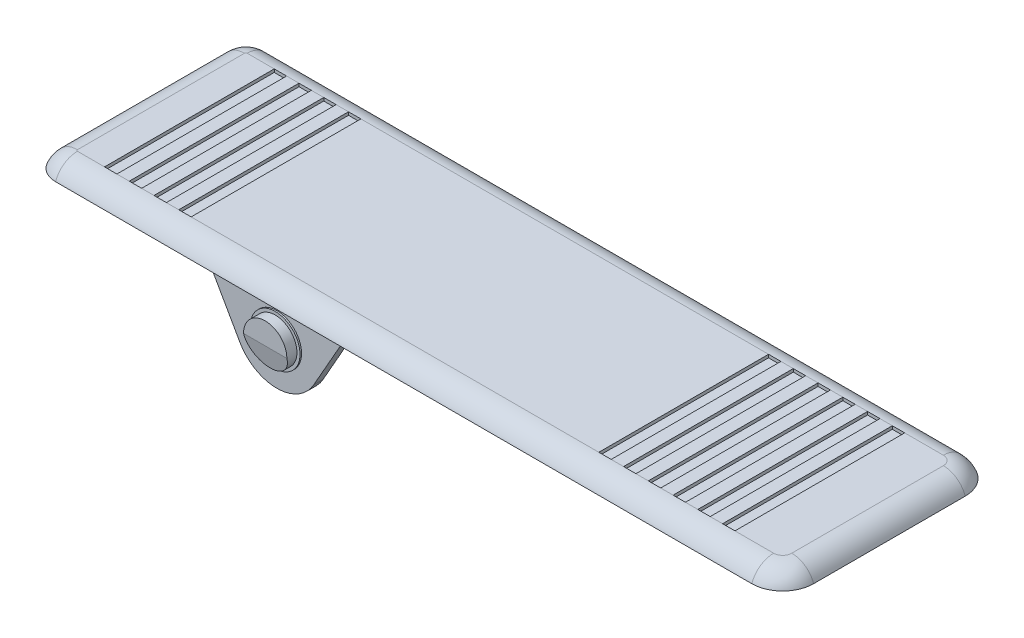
ISO-10303-21;
HEADER;
FILE_DESCRIPTION(('STEP AP214'),'2;1');
FILE_NAME('part.step','',(''),(''),'','','');
FILE_SCHEMA(('AUTOMOTIVE_DESIGN { 1 0 10303 214 1 1 1 1 }'));
ENDSEC;
DATA;
#1=APPLICATION_CONTEXT('core data for automotive mechanical design processes');
#2=APPLICATION_PROTOCOL_DEFINITION('international standard','automotive_design',2000,#1);
#3=PRODUCT_CONTEXT('',#1,'mechanical');
#4=PRODUCT('Part','Part','',(#3));
#5=PRODUCT_RELATED_PRODUCT_CATEGORY('part','',(#4));
#6=PRODUCT_DEFINITION_FORMATION('','',#4);
#7=PRODUCT_DEFINITION_CONTEXT('part definition',#1,'design');
#8=PRODUCT_DEFINITION('design','',#6,#7);
#9=PRODUCT_DEFINITION_SHAPE('','',#8);
#10=(LENGTH_UNIT() NAMED_UNIT(*) SI_UNIT(.MILLI.,.METRE.));
#11=(NAMED_UNIT(*) PLANE_ANGLE_UNIT() SI_UNIT($,.RADIAN.));
#12=(NAMED_UNIT(*) SI_UNIT($,.STERADIAN.) SOLID_ANGLE_UNIT());
#13=UNCERTAINTY_MEASURE_WITH_UNIT(LENGTH_MEASURE(1.E-05),#10,'distance_accuracy_value','');
#14=(GEOMETRIC_REPRESENTATION_CONTEXT(3) GLOBAL_UNCERTAINTY_ASSIGNED_CONTEXT((#13)) GLOBAL_UNIT_ASSIGNED_CONTEXT((#10,
#11,#12)) REPRESENTATION_CONTEXT('',''));
#15=CARTESIAN_POINT('',(0.,0.,0.));
#16=DIRECTION('',(0.,0.,1.));
#17=DIRECTION('',(1.,0.,0.));
#18=AXIS2_PLACEMENT_3D('',#15,#16,#17);
#19=CARTESIAN_POINT('',(3.81,2.54,-3.81));
#20=DIRECTION('',(0.,1.,0.));
#21=DIRECTION('',(0.,0.,1.));
#22=AXIS2_PLACEMENT_3D('',#19,#20,#21);
#23=PLANE('',#22);
#24=DIRECTION('',(0.,0.,-1.));
#25=VECTOR('',#24,1.);
#26=CARTESIAN_POINT('',(22.479,2.54,-3.59210244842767));
#27=LINE('',#26,#25);
#28=CARTESIAN_POINT('',(22.479,2.54,-3.59210244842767));
#29=VERTEX_POINT('',#28);
#30=CARTESIAN_POINT('',(22.479,2.54,-31.4598975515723));
#31=VERTEX_POINT('',#30);
#32=EDGE_CURVE('E42',#29,#31,#27,.T.);
#33=ORIENTED_EDGE('',*,*,#32,.F.);
#34=DIRECTION('',(-1.,0.,0.));
#35=VECTOR('',#34,1.);
#36=CARTESIAN_POINT('',(3.81000000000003,2.54,-3.59210244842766));
#37=LINE('',#36,#35);
#38=CARTESIAN_POINT('',(89.408,2.54,-3.59210244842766));
#39=VERTEX_POINT('',#38);
#40=EDGE_CURVE('E958',#29,#39,#37,.F.);
#41=ORIENTED_EDGE('',*,*,#40,.T.);
#42=DIRECTION('',(0.,0.,1.));
#43=VECTOR('',#42,1.);
#44=CARTESIAN_POINT('',(89.408,2.54,-31.4598975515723));
#45=LINE('',#44,#43);
#46=CARTESIAN_POINT('',(89.408,2.54,-31.4598975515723));
#47=VERTEX_POINT('',#46);
#48=EDGE_CURVE('E574',#47,#39,#45,.T.);
#49=ORIENTED_EDGE('',*,*,#48,.F.);
#50=DIRECTION('',(1.,0.,0.));
#51=VECTOR('',#50,1.);
#52=CARTESIAN_POINT('',(118.11,2.54,-31.4598975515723));
#53=LINE('',#52,#51);
#54=EDGE_CURVE('E516',#47,#31,#53,.F.);
#55=ORIENTED_EDGE('',*,*,#54,.T.);
#56=EDGE_LOOP('',(#33,#41,#49,#55));
#57=FACE_BOUND('',#56,.T.);
#58=ADVANCED_FACE('F27',(#57),#23,.T.);
#59=DIRECTION('',(0.,0.,1.));
#60=VECTOR('',#59,1.);
#61=CARTESIAN_POINT('',(20.447,2.54,-31.4598975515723));
#62=LINE('',#61,#60);
#63=CARTESIAN_POINT('',(20.447,2.54,-31.4598975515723));
#64=VERTEX_POINT('',#63);
#65=CARTESIAN_POINT('',(20.447,2.54,-3.59210244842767));
#66=VERTEX_POINT('',#65);
#67=EDGE_CURVE('E489',#64,#66,#62,.T.);
#68=ORIENTED_EDGE('',*,*,#67,.F.);
#69=CARTESIAN_POINT('',(18.415,2.54,-31.4598975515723));
#70=VERTEX_POINT('',#69);
#71=EDGE_CURVE('E50',#64,#70,#53,.F.);
#72=ORIENTED_EDGE('',*,*,#71,.T.);
#73=DIRECTION('',(0.,0.,-1.));
#74=VECTOR('',#73,1.);
#75=CARTESIAN_POINT('',(18.415,2.54,-3.59210244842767));
#76=LINE('',#75,#74);
#77=CARTESIAN_POINT('',(18.415,2.54,-3.59210244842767));
#78=VERTEX_POINT('',#77);
#79=EDGE_CURVE('E1777',#78,#70,#76,.T.);
#80=ORIENTED_EDGE('',*,*,#79,.F.);
#81=EDGE_CURVE('E508',#78,#66,#37,.F.);
#82=ORIENTED_EDGE('',*,*,#81,.T.);
#83=EDGE_LOOP('',(#68,#72,#80,#82));
#84=FACE_BOUND('',#83,.T.);
#85=ADVANCED_FACE('F506',(#84),#23,.T.);
#86=DIRECTION('',(0.,0.,1.));
#87=VECTOR('',#86,1.);
#88=CARTESIAN_POINT('',(16.383,2.54,-31.4598975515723));
#89=LINE('',#88,#87);
#90=CARTESIAN_POINT('',(16.383,2.54,-31.4598975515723));
#91=VERTEX_POINT('',#90);
#92=CARTESIAN_POINT('',(16.383,2.54,-3.59210244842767));
#93=VERTEX_POINT('',#92);
#94=EDGE_CURVE('E1076',#91,#93,#89,.T.);
#95=ORIENTED_EDGE('',*,*,#94,.F.);
#96=CARTESIAN_POINT('',(14.351,2.54,-31.4598975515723));
#97=VERTEX_POINT('',#96);
#98=EDGE_CURVE('E517',#91,#97,#53,.F.);
#99=ORIENTED_EDGE('',*,*,#98,.T.);
#100=DIRECTION('',(0.,0.,-1.));
#101=VECTOR('',#100,1.);
#102=CARTESIAN_POINT('',(14.351,2.54,-3.59210244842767));
#103=LINE('',#102,#101);
#104=CARTESIAN_POINT('',(14.351,2.54,-3.59210244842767));
#105=VERTEX_POINT('',#104);
#106=EDGE_CURVE('E1078',#105,#97,#103,.T.);
#107=ORIENTED_EDGE('',*,*,#106,.F.);
#108=EDGE_CURVE('E1068',#105,#93,#37,.F.);
#109=ORIENTED_EDGE('',*,*,#108,.T.);
#110=EDGE_LOOP('',(#95,#99,#107,#109));
#111=FACE_BOUND('',#110,.T.);
#112=ADVANCED_FACE('F1074',(#111),#23,.T.);
#113=DIRECTION('',(0.,0.,1.));
#114=VECTOR('',#113,1.);
#115=CARTESIAN_POINT('',(12.319,2.54,-31.4598975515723));
#116=LINE('',#115,#114);
#117=CARTESIAN_POINT('',(12.319,2.54,-31.4598975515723));
#118=VERTEX_POINT('',#117);
#119=CARTESIAN_POINT('',(12.319,2.54,-3.59210244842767));
#120=VERTEX_POINT('',#119);
#121=EDGE_CURVE('E983',#118,#120,#116,.T.);
#122=ORIENTED_EDGE('',*,*,#121,.F.);
#123=CARTESIAN_POINT('',(10.287,2.54,-31.4598975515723));
#124=VERTEX_POINT('',#123);
#125=EDGE_CURVE('E522',#118,#124,#53,.F.);
#126=ORIENTED_EDGE('',*,*,#125,.T.);
#127=DIRECTION('',(0.,0.,-1.));
#128=VECTOR('',#127,1.);
#129=CARTESIAN_POINT('',(10.287,2.54,-3.59210244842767));
#130=LINE('',#129,#128);
#131=CARTESIAN_POINT('',(10.287,2.54,-3.59210244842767));
#132=VERTEX_POINT('',#131);
#133=EDGE_CURVE('E980',#132,#124,#130,.T.);
#134=ORIENTED_EDGE('',*,*,#133,.F.);
#135=EDGE_CURVE('E957',#132,#120,#37,.F.);
#136=ORIENTED_EDGE('',*,*,#135,.T.);
#137=EDGE_LOOP('',(#122,#126,#134,#136));
#138=FACE_BOUND('',#137,.T.);
#139=ADVANCED_FACE('F978',(#138),#23,.T.);
#140=DIRECTION('',(0.,0.,-1.));
#141=VECTOR('',#140,1.);
#142=CARTESIAN_POINT('',(91.44,2.54,-3.59210244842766));
#143=LINE('',#142,#141);
#144=CARTESIAN_POINT('',(91.44,2.54,-3.59210244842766));
#145=VERTEX_POINT('',#144);
#146=CARTESIAN_POINT('',(91.44,2.54,-31.4598975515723));
#147=VERTEX_POINT('',#146);
#148=EDGE_CURVE('E561',#145,#147,#143,.T.);
#149=ORIENTED_EDGE('',*,*,#148,.F.);
#150=CARTESIAN_POINT('',(93.472,2.54,-3.59210244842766));
#151=VERTEX_POINT('',#150);
#152=EDGE_CURVE('E1066',#145,#151,#37,.F.);
#153=ORIENTED_EDGE('',*,*,#152,.T.);
#154=DIRECTION('',(0.,0.,1.));
#155=VECTOR('',#154,1.);
#156=CARTESIAN_POINT('',(93.472,2.54,-31.4598975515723));
#157=LINE('',#156,#155);
#158=CARTESIAN_POINT('',(93.472,2.54,-31.4598975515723));
#159=VERTEX_POINT('',#158);
#160=EDGE_CURVE('E564',#159,#151,#157,.T.);
#161=ORIENTED_EDGE('',*,*,#160,.F.);
#162=EDGE_CURVE('E520',#159,#147,#53,.F.);
#163=ORIENTED_EDGE('',*,*,#162,.T.);
#164=EDGE_LOOP('',(#149,#153,#161,#163));
#165=FACE_BOUND('',#164,.T.);
#166=ADVANCED_FACE('F560',(#165),#23,.T.);
#167=DIRECTION('',(0.,0.,-1.));
#168=VECTOR('',#167,1.);
#169=CARTESIAN_POINT('',(95.504,2.54,-3.59210244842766));
#170=LINE('',#169,#168);
#171=CARTESIAN_POINT('',(95.504,2.54,-3.59210244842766));
#172=VERTEX_POINT('',#171);
#173=CARTESIAN_POINT('',(95.504,2.54,-31.4598975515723));
#174=VERTEX_POINT('',#173);
#175=EDGE_CURVE('E598',#172,#174,#170,.T.);
#176=ORIENTED_EDGE('',*,*,#175,.F.);
#177=CARTESIAN_POINT('',(97.536,2.54,-3.59210244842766));
#178=VERTEX_POINT('',#177);
#179=EDGE_CURVE('E1064',#172,#178,#37,.F.);
#180=ORIENTED_EDGE('',*,*,#179,.T.);
#181=DIRECTION('',(0.,0.,1.));
#182=VECTOR('',#181,1.);
#183=CARTESIAN_POINT('',(97.536,2.54,-31.4598975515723));
#184=LINE('',#183,#182);
#185=CARTESIAN_POINT('',(97.536,2.54,-31.4598975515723));
#186=VERTEX_POINT('',#185);
#187=EDGE_CURVE('E636',#186,#178,#184,.T.);
#188=ORIENTED_EDGE('',*,*,#187,.F.);
#189=EDGE_CURVE('E545',#186,#174,#53,.F.);
#190=ORIENTED_EDGE('',*,*,#189,.T.);
#191=EDGE_LOOP('',(#176,#180,#188,#190));
#192=FACE_BOUND('',#191,.T.);
#193=ADVANCED_FACE('F1799',(#192),#23,.T.);
#194=DIRECTION('',(0.,0.,-1.));
#195=VECTOR('',#194,1.);
#196=CARTESIAN_POINT('',(99.568,2.54,-3.59210244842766));
#197=LINE('',#196,#195);
#198=CARTESIAN_POINT('',(99.568,2.54,-3.59210244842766));
#199=VERTEX_POINT('',#198);
#200=CARTESIAN_POINT('',(99.568,2.54,-31.4598975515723));
#201=VERTEX_POINT('',#200);
#202=EDGE_CURVE('E624',#199,#201,#197,.T.);
#203=ORIENTED_EDGE('',*,*,#202,.F.);
#204=CARTESIAN_POINT('',(101.6,2.54,-3.59210244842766));
#205=VERTEX_POINT('',#204);
#206=EDGE_CURVE('E1062',#199,#205,#37,.F.);
#207=ORIENTED_EDGE('',*,*,#206,.T.);
#208=DIRECTION('',(0.,0.,1.));
#209=VECTOR('',#208,1.);
#210=CARTESIAN_POINT('',(101.6,2.54,-31.4598975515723));
#211=LINE('',#210,#209);
#212=CARTESIAN_POINT('',(101.6,2.54,-31.4598975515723));
#213=VERTEX_POINT('',#212);
#214=EDGE_CURVE('E667',#213,#205,#211,.T.);
#215=ORIENTED_EDGE('',*,*,#214,.F.);
#216=EDGE_CURVE('E539',#213,#201,#53,.F.);
#217=ORIENTED_EDGE('',*,*,#216,.T.);
#218=EDGE_LOOP('',(#203,#207,#215,#217));
#219=FACE_BOUND('',#218,.T.);
#220=ADVANCED_FACE('F1186',(#219),#23,.T.);
#221=DIRECTION('',(0.,0.,-1.));
#222=VECTOR('',#221,1.);
#223=CARTESIAN_POINT('',(103.632,2.54,-3.59210244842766));
#224=LINE('',#223,#222);
#225=CARTESIAN_POINT('',(103.632,2.54,-3.59210244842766));
#226=VERTEX_POINT('',#225);
#227=CARTESIAN_POINT('',(103.632,2.54,-31.4598975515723));
#228=VERTEX_POINT('',#227);
#229=EDGE_CURVE('E655',#226,#228,#224,.T.);
#230=ORIENTED_EDGE('',*,*,#229,.F.);
#231=CARTESIAN_POINT('',(105.664,2.54,-3.59210244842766));
#232=VERTEX_POINT('',#231);
#233=EDGE_CURVE('E1060',#226,#232,#37,.F.);
#234=ORIENTED_EDGE('',*,*,#233,.T.);
#235=DIRECTION('',(0.,0.,1.));
#236=VECTOR('',#235,1.);
#237=CARTESIAN_POINT('',(105.664,2.54,-31.4598975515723));
#238=LINE('',#237,#236);
#239=CARTESIAN_POINT('',(105.664,2.54,-31.4598975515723));
#240=VERTEX_POINT('',#239);
#241=EDGE_CURVE('E698',#240,#232,#238,.T.);
#242=ORIENTED_EDGE('',*,*,#241,.F.);
#243=EDGE_CURVE('E533',#240,#228,#53,.F.);
#244=ORIENTED_EDGE('',*,*,#243,.T.);
#245=EDGE_LOOP('',(#230,#234,#242,#244));
#246=FACE_BOUND('',#245,.T.);
#247=ADVANCED_FACE('F1182',(#246),#23,.T.);
#248=DIRECTION('',(0.,0.,-1.));
#249=VECTOR('',#248,1.);
#250=CARTESIAN_POINT('',(107.696,2.54,-3.59210244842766));
#251=LINE('',#250,#249);
#252=CARTESIAN_POINT('',(107.696,2.54,-3.59210244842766));
#253=VERTEX_POINT('',#252);
#254=CARTESIAN_POINT('',(107.696,2.54,-31.4598975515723));
#255=VERTEX_POINT('',#254);
#256=EDGE_CURVE('E686',#253,#255,#251,.T.);
#257=ORIENTED_EDGE('',*,*,#256,.F.);
#258=CARTESIAN_POINT('',(109.728,2.54,-3.59210244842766));
#259=VERTEX_POINT('',#258);
#260=EDGE_CURVE('E1059',#253,#259,#37,.F.);
#261=ORIENTED_EDGE('',*,*,#260,.T.);
#262=DIRECTION('',(0.,0.,1.));
#263=VECTOR('',#262,1.);
#264=CARTESIAN_POINT('',(109.728,2.54,-31.4598975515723));
#265=LINE('',#264,#263);
#266=CARTESIAN_POINT('',(109.728,2.54,-31.4598975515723));
#267=VERTEX_POINT('',#266);
#268=EDGE_CURVE('E729',#267,#259,#265,.T.);
#269=ORIENTED_EDGE('',*,*,#268,.F.);
#270=EDGE_CURVE('E527',#267,#255,#53,.F.);
#271=ORIENTED_EDGE('',*,*,#270,.T.);
#272=EDGE_LOOP('',(#257,#261,#269,#271));
#273=FACE_BOUND('',#272,.T.);
#274=ADVANCED_FACE('F1174',(#273),#23,.T.);
#275=DIRECTION('',(0.,0.,-1.));
#276=VECTOR('',#275,1.);
#277=CARTESIAN_POINT('',(111.76,2.54,-3.59210244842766));
#278=LINE('',#277,#276);
#279=CARTESIAN_POINT('',(111.76,2.54,-3.59210244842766));
#280=VERTEX_POINT('',#279);
#281=CARTESIAN_POINT('',(111.76,2.54,-31.4598975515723));
#282=VERTEX_POINT('',#281);
#283=EDGE_CURVE('E717',#280,#282,#278,.T.);
#284=ORIENTED_EDGE('',*,*,#283,.F.);
#285=CARTESIAN_POINT('',(118.11,2.54,-3.59210244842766));
#286=VERTEX_POINT('',#285);
#287=EDGE_CURVE('E952',#280,#286,#37,.F.);
#288=ORIENTED_EDGE('',*,*,#287,.T.);
#289=CARTESIAN_POINT('',(118.11,2.54,-5.08));
#290=DIRECTION('',(0.,1.,0.));
#291=DIRECTION('',(0.,0.,1.));
#292=AXIS2_PLACEMENT_3D('',#289,#290,#291);
#293=CIRCLE('',#292,1.48789755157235);
#294=CARTESIAN_POINT('',(119.597897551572,2.54,-5.08));
#295=VERTEX_POINT('',#294);
#296=EDGE_CURVE('E956',#286,#295,#293,.T.);
#297=ORIENTED_EDGE('',*,*,#296,.T.);
#298=DIRECTION('',(0.,0.,-1.));
#299=VECTOR('',#298,1.);
#300=CARTESIAN_POINT('',(119.597897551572,2.54,-29.972));
#301=LINE('',#300,#299);
#302=CARTESIAN_POINT('',(119.597897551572,2.54,-29.972));
#303=VERTEX_POINT('',#302);
#304=EDGE_CURVE('E962',#295,#303,#301,.T.);
#305=ORIENTED_EDGE('',*,*,#304,.T.);
#306=CARTESIAN_POINT('',(118.11,2.54,-29.972));
#307=DIRECTION('',(0.,1.,0.));
#308=DIRECTION('',(0.,0.,1.));
#309=AXIS2_PLACEMENT_3D('',#306,#307,#308);
#310=CIRCLE('',#309,1.48789755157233);
#311=CARTESIAN_POINT('',(118.11,2.54,-31.4598975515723));
#312=VERTEX_POINT('',#311);
#313=EDGE_CURVE('E966',#303,#312,#310,.T.);
#314=ORIENTED_EDGE('',*,*,#313,.T.);
#315=EDGE_CURVE('E519',#312,#282,#53,.F.);
#316=ORIENTED_EDGE('',*,*,#315,.T.);
#317=EDGE_LOOP('',(#284,#288,#297,#305,#314,#316));
#318=FACE_BOUND('',#317,.T.);
#319=ADVANCED_FACE('F1057',(#318),#23,.T.);
#320=CARTESIAN_POINT('',(3.81,0.,-3.81));
#321=DIRECTION('',(0.,1.,0.));
#322=DIRECTION('',(0.,0.,1.));
#323=AXIS2_PLACEMENT_3D('',#320,#321,#322);
#324=PLANE('',#323);
#325=DIRECTION('',(0.,0.,1.));
#326=VECTOR('',#325,1.);
#327=CARTESIAN_POINT('',(119.634,0.,-30.988));
#328=LINE('',#327,#326);
#329=CARTESIAN_POINT('',(119.634,0.,-30.988));
#330=VERTEX_POINT('',#329);
#331=CARTESIAN_POINT('',(119.634,0.,-4.064));
#332=VERTEX_POINT('',#331);
#333=EDGE_CURVE('E783',#330,#332,#328,.T.);
#334=ORIENTED_EDGE('',*,*,#333,.F.);
#335=CARTESIAN_POINT('',(118.872,0.,-30.988));
#336=DIRECTION('',(0.,1.,0.));
#337=DIRECTION('',(0.,0.,1.));
#338=AXIS2_PLACEMENT_3D('',#335,#336,#337);
#339=CIRCLE('',#338,0.761999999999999);
#340=CARTESIAN_POINT('',(118.11,0.,-30.988));
#341=VERTEX_POINT('',#340);
#342=EDGE_CURVE('E776',#330,#341,#339,.T.);
#343=ORIENTED_EDGE('',*,*,#342,.T.);
#344=DIRECTION('',(0.,0.,-1.));
#345=VECTOR('',#344,1.);
#346=CARTESIAN_POINT('',(118.11,0.,-4.064));
#347=LINE('',#346,#345);
#348=CARTESIAN_POINT('',(118.11,0.,-4.064));
#349=VERTEX_POINT('',#348);
#350=EDGE_CURVE('E778',#349,#341,#347,.T.);
#351=ORIENTED_EDGE('',*,*,#350,.F.);
#352=CARTESIAN_POINT('',(118.872,0.,-4.064));
#353=DIRECTION('',(0.,1.,0.));
#354=DIRECTION('',(0.,0.,1.));
#355=AXIS2_PLACEMENT_3D('',#352,#353,#354);
#356=CIRCLE('',#355,0.761999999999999);
#357=EDGE_CURVE('E781',#349,#332,#356,.T.);
#358=ORIENTED_EDGE('',*,*,#357,.T.);
#359=EDGE_LOOP('',(#334,#343,#351,#358));
#360=FACE_BOUND('',#359,.T.);
#361=DIRECTION('',(1.,0.,0.));
#362=VECTOR('',#361,1.);
#363=CARTESIAN_POINT('',(5.08,0.,-31.75));
#364=LINE('',#363,#362);
#365=CARTESIAN_POINT('',(5.842,0.,-31.75));
#366=VERTEX_POINT('',#365);
#367=CARTESIAN_POINT('',(110.236,0.,-31.75));
#368=VERTEX_POINT('',#367);
#369=EDGE_CURVE('E806',#366,#368,#364,.T.);
#370=ORIENTED_EDGE('',*,*,#369,.F.);
#371=CARTESIAN_POINT('',(5.842,0.,-30.988));
#372=DIRECTION('',(0.,1.,0.));
#373=DIRECTION('',(0.,0.,1.));
#374=AXIS2_PLACEMENT_3D('',#371,#372,#373);
#375=CIRCLE('',#374,0.762);
#376=CARTESIAN_POINT('',(5.08,0.,-30.988));
#377=VERTEX_POINT('',#376);
#378=EDGE_CURVE('E2090',#366,#377,#375,.T.);
#379=ORIENTED_EDGE('',*,*,#378,.T.);
#380=CARTESIAN_POINT('',(5.842,0.,-30.988));
#381=DIRECTION('',(0.,1.,0.));
#382=DIRECTION('',(0.,0.,1.));
#383=AXIS2_PLACEMENT_3D('',#380,#381,#382);
#384=CIRCLE('',#383,0.762);
#385=CARTESIAN_POINT('',(5.842,0.,-30.226));
#386=VERTEX_POINT('',#385);
#387=EDGE_CURVE('E2088',#377,#386,#384,.T.);
#388=ORIENTED_EDGE('',*,*,#387,.T.);
#389=DIRECTION('',(1.,0.,0.));
#390=VECTOR('',#389,1.);
#391=CARTESIAN_POINT('',(5.08,0.,-30.226));
#392=LINE('',#391,#390);
#393=CARTESIAN_POINT('',(110.236,0.,-30.226));
#394=VERTEX_POINT('',#393);
#395=EDGE_CURVE('E822',#386,#394,#392,.T.);
#396=ORIENTED_EDGE('',*,*,#395,.T.);
#397=CARTESIAN_POINT('',(110.236,0.,-30.988));
#398=DIRECTION('',(0.,1.,0.));
#399=DIRECTION('',(0.,0.,1.));
#400=AXIS2_PLACEMENT_3D('',#397,#398,#399);
#401=CIRCLE('',#400,0.762);
#402=CARTESIAN_POINT('',(110.998,0.,-30.988));
#403=VERTEX_POINT('',#402);
#404=EDGE_CURVE('E2094',#394,#403,#401,.T.);
#405=ORIENTED_EDGE('',*,*,#404,.T.);
#406=CARTESIAN_POINT('',(110.236,0.,-30.988));
#407=DIRECTION('',(0.,1.,0.));
#408=DIRECTION('',(0.,0.,1.));
#409=AXIS2_PLACEMENT_3D('',#406,#407,#408);
#410=CIRCLE('',#409,0.762);
#411=EDGE_CURVE('E2092',#403,#368,#410,.T.);
#412=ORIENTED_EDGE('',*,*,#411,.T.);
#413=EDGE_LOOP('',(#370,#379,#388,#396,#405,#412));
#414=FACE_BOUND('',#413,.T.);
#415=CARTESIAN_POINT('',(110.236,0.,-4.064));
#416=DIRECTION('',(0.,1.,0.));
#417=DIRECTION('',(0.,0.,1.));
#418=AXIS2_PLACEMENT_3D('',#415,#416,#417);
#419=CIRCLE('',#418,0.762);
#420=CARTESIAN_POINT('',(110.236,0.,-3.302));
#421=VERTEX_POINT('',#420);
#422=CARTESIAN_POINT('',(110.998,0.,-4.064));
#423=VERTEX_POINT('',#422);
#424=EDGE_CURVE('E2061',#421,#423,#419,.T.);
#425=ORIENTED_EDGE('',*,*,#424,.T.);
#426=CARTESIAN_POINT('',(110.236,0.,-4.064));
#427=DIRECTION('',(0.,1.,0.));
#428=DIRECTION('',(0.,0.,1.));
#429=AXIS2_PLACEMENT_3D('',#426,#427,#428);
#430=CIRCLE('',#429,0.762);
#431=CARTESIAN_POINT('',(110.236,0.,-4.826));
#432=VERTEX_POINT('',#431);
#433=EDGE_CURVE('E2063',#423,#432,#430,.T.);
#434=ORIENTED_EDGE('',*,*,#433,.T.);
#435=DIRECTION('',(1.,0.,0.));
#436=VECTOR('',#435,1.);
#437=CARTESIAN_POINT('',(5.08,0.,-4.826));
#438=LINE('',#437,#436);
#439=CARTESIAN_POINT('',(5.842,0.,-4.826));
#440=VERTEX_POINT('',#439);
#441=EDGE_CURVE('E895',#440,#432,#438,.T.);
#442=ORIENTED_EDGE('',*,*,#441,.F.);
#443=CARTESIAN_POINT('',(5.842,0.,-4.064));
#444=DIRECTION('',(0.,1.,0.));
#445=DIRECTION('',(0.,0.,1.));
#446=AXIS2_PLACEMENT_3D('',#443,#444,#445);
#447=CIRCLE('',#446,0.762);
#448=CARTESIAN_POINT('',(5.08,0.,-4.064));
#449=VERTEX_POINT('',#448);
#450=EDGE_CURVE('E2058',#440,#449,#447,.T.);
#451=ORIENTED_EDGE('',*,*,#450,.T.);
#452=CARTESIAN_POINT('',(5.842,0.,-4.064));
#453=DIRECTION('',(0.,1.,0.));
#454=DIRECTION('',(0.,0.,1.));
#455=AXIS2_PLACEMENT_3D('',#452,#453,#454);
#456=CIRCLE('',#455,0.762);
#457=CARTESIAN_POINT('',(5.842,0.,-3.302));
#458=VERTEX_POINT('',#457);
#459=EDGE_CURVE('E2040',#449,#458,#456,.T.);
#460=ORIENTED_EDGE('',*,*,#459,.T.);
#461=DIRECTION('',(1.,0.,0.));
#462=VECTOR('',#461,1.);
#463=CARTESIAN_POINT('',(5.08,0.,-3.302));
#464=LINE('',#463,#462);
#465=EDGE_CURVE('E879',#458,#421,#464,.T.);
#466=ORIENTED_EDGE('',*,*,#465,.T.);
#467=EDGE_LOOP('',(#425,#434,#442,#451,#460,#466));
#468=FACE_BOUND('',#467,.T.);
#469=CARTESIAN_POINT('',(3.81,0.,-3.81));
#470=DIRECTION('',(0.,1.,0.));
#471=DIRECTION('',(0.,0.,1.));
#472=AXIS2_PLACEMENT_3D('',#469,#470,#471);
#473=CIRCLE('',#472,3.81);
#474=CARTESIAN_POINT('',(0.,0.,-3.81000000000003));
#475=VERTEX_POINT('',#474);
#476=CARTESIAN_POINT('',(3.81000000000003,0.,0.));
#477=VERTEX_POINT('',#476);
#478=EDGE_CURVE('E931',#475,#477,#473,.T.);
#479=ORIENTED_EDGE('',*,*,#478,.F.);
#480=DIRECTION('',(0.,0.,-1.));
#481=VECTOR('',#480,1.);
#482=CARTESIAN_POINT('',(0.,0.,-3.81000000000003));
#483=LINE('',#482,#481);
#484=CARTESIAN_POINT('',(0.,0.,-31.242));
#485=VERTEX_POINT('',#484);
#486=EDGE_CURVE('E950',#475,#485,#483,.T.);
#487=ORIENTED_EDGE('',*,*,#486,.T.);
#488=CARTESIAN_POINT('',(3.81,0.,-31.242));
#489=DIRECTION('',(0.,1.,0.));
#490=DIRECTION('',(0.,0.,1.));
#491=AXIS2_PLACEMENT_3D('',#488,#489,#490);
#492=CIRCLE('',#491,3.81);
#493=CARTESIAN_POINT('',(3.81,0.,-35.052));
#494=VERTEX_POINT('',#493);
#495=EDGE_CURVE('E947',#494,#485,#492,.T.);
#496=ORIENTED_EDGE('',*,*,#495,.F.);
#497=DIRECTION('',(-1.,0.,0.));
#498=VECTOR('',#497,1.);
#499=CARTESIAN_POINT('',(118.11,0.,-35.052));
#500=LINE('',#499,#498);
#501=CARTESIAN_POINT('',(118.11,0.,-35.052));
#502=VERTEX_POINT('',#501);
#503=EDGE_CURVE('E944',#502,#494,#500,.T.);
#504=ORIENTED_EDGE('',*,*,#503,.F.);
#505=CARTESIAN_POINT('',(118.11,0.,-29.972));
#506=DIRECTION('',(0.,1.,0.));
#507=DIRECTION('',(0.,0.,1.));
#508=AXIS2_PLACEMENT_3D('',#505,#506,#507);
#509=CIRCLE('',#508,5.07999999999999);
#510=CARTESIAN_POINT('',(123.19,0.,-29.972));
#511=VERTEX_POINT('',#510);
#512=EDGE_CURVE('E941',#511,#502,#509,.T.);
#513=ORIENTED_EDGE('',*,*,#512,.F.);
#514=DIRECTION('',(0.,0.,1.));
#515=VECTOR('',#514,1.);
#516=CARTESIAN_POINT('',(123.19,0.,-29.972));
#517=LINE('',#516,#515);
#518=CARTESIAN_POINT('',(123.19,0.,-5.08));
#519=VERTEX_POINT('',#518);
#520=EDGE_CURVE('E939',#511,#519,#517,.T.);
#521=ORIENTED_EDGE('',*,*,#520,.T.);
#522=CARTESIAN_POINT('',(118.11,0.,-5.08));
#523=DIRECTION('',(0.,-1.,0.));
#524=DIRECTION('',(0.,0.,-1.));
#525=AXIS2_PLACEMENT_3D('',#522,#523,#524);
#526=CIRCLE('',#525,5.08000000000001);
#527=CARTESIAN_POINT('',(118.11,0.,0.));
#528=VERTEX_POINT('',#527);
#529=EDGE_CURVE('E937',#519,#528,#526,.T.);
#530=ORIENTED_EDGE('',*,*,#529,.T.);
#531=DIRECTION('',(1.,0.,0.));
#532=VECTOR('',#531,1.);
#533=CARTESIAN_POINT('',(3.81000000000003,0.,0.));
#534=LINE('',#533,#532);
#535=EDGE_CURVE('E934',#477,#528,#534,.T.);
#536=ORIENTED_EDGE('',*,*,#535,.F.);
#537=EDGE_LOOP('',(#479,#487,#496,#504,#513,#521,#530,#536));
#538=FACE_BOUND('',#537,.T.);
#539=CARTESIAN_POINT('',(14.605,0.,-17.526));
#540=DIRECTION('',(0.,1.,0.));
#541=DIRECTION('',(0.,0.,1.));
#542=AXIS2_PLACEMENT_3D('',#539,#540,#541);
#543=CIRCLE('',#542,9.271);
#544=CARTESIAN_POINT('',(14.605,0.,-8.25500000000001));
#545=VERTEX_POINT('',#544);
#546=EDGE_CURVE('E11',#545,#545,#543,.F.);
#547=ORIENTED_EDGE('',*,*,#546,.F.);
#548=EDGE_LOOP('',(#547));
#549=FACE_BOUND('',#548,.T.);
#550=ADVANCED_FACE('F1046',(#360,#414,#468,#538,#549),#324,.F.);
#551=CARTESIAN_POINT('',(36.83,-7.5184,-1.397));
#552=DIRECTION('',(0.,0.,-1.));
#553=DIRECTION('',(-1.,0.,0.));
#554=AXIS2_PLACEMENT_3D('',#551,#552,#553);
#555=CYLINDRICAL_SURFACE('',#554,3.55600000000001);
#556=CARTESIAN_POINT('',(36.83,-7.5184,-3.048));
#557=DIRECTION('',(0.,0.,1.));
#558=DIRECTION('',(1.,0.,0.));
#559=AXIS2_PLACEMENT_3D('',#556,#557,#558);
#560=CIRCLE('',#559,3.55600000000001);
#561=CARTESIAN_POINT('',(40.386,-7.5184,-3.048));
#562=VERTEX_POINT('',#561);
#563=EDGE_CURVE('E856',#562,#562,#560,.F.);
#564=ORIENTED_EDGE('',*,*,#563,.F.);
#565=EDGE_LOOP('',(#564));
#566=FACE_BOUND('',#565,.T.);
#567=CARTESIAN_POINT('',(36.83,-7.5184,-1.397));
#568=DIRECTION('',(0.,0.,1.));
#569=DIRECTION('',(1.,0.,0.));
#570=AXIS2_PLACEMENT_3D('',#567,#568,#569);
#571=CIRCLE('',#570,3.55600000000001);
#572=CARTESIAN_POINT('',(40.386,-7.5184,-1.397));
#573=VERTEX_POINT('',#572);
#574=CARTESIAN_POINT('',(33.274,-7.5184,-1.397));
#575=VERTEX_POINT('',#574);
#576=EDGE_CURVE('E853',#573,#575,#571,.T.);
#577=ORIENTED_EDGE('',*,*,#576,.F.);
#578=CARTESIAN_POINT('',(36.83,-7.5184,-1.397));
#579=DIRECTION('',(0.,-0.226129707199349,0.974097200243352));
#580=DIRECTION('',(0.,-0.974097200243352,-0.226129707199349));
#581=AXIS2_PLACEMENT_3D('',#578,#579,#580);
#582=ELLIPSE('',#581,3.65055971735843,3.55600000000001);
#583=EDGE_CURVE('E851',#575,#573,#582,.T.);
#584=ORIENTED_EDGE('',*,*,#583,.F.);
#585=EDGE_LOOP('',(#577,#584));
#586=FACE_BOUND('',#585,.T.);
#587=ADVANCED_FACE('F1179',(#566,#586),#555,.T.);
#588=CARTESIAN_POINT('',(36.83,-7.5184,-1.397));
#589=DIRECTION('',(0.,0.,1.));
#590=DIRECTION('',(1.,0.,0.));
#591=AXIS2_PLACEMENT_3D('',#588,#589,#590);
#592=PLANE('',#591);
#593=ORIENTED_EDGE('',*,*,#576,.T.);
#594=DIRECTION('',(1.,0.,0.));
#595=VECTOR('',#594,1.);
#596=CARTESIAN_POINT('',(0.,-7.5184,-1.397));
#597=LINE('',#596,#595);
#598=EDGE_CURVE('E842',#575,#573,#597,.T.);
#599=ORIENTED_EDGE('',*,*,#598,.T.);
#600=EDGE_LOOP('',(#593,#599));
#601=FACE_BOUND('',#600,.T.);
#602=ADVANCED_FACE('F1340',(#601),#592,.T.);
#603=CARTESIAN_POINT('',(36.83,-7.5184,-3.048));
#604=DIRECTION('',(0.,0.,1.));
#605=DIRECTION('',(1.,0.,0.));
#606=AXIS2_PLACEMENT_3D('',#603,#604,#605);
#607=PLANE('',#606);
#608=CARTESIAN_POINT('',(36.83,-7.5184,-3.048));
#609=DIRECTION('',(0.,0.,1.));
#610=DIRECTION('',(1.,0.,0.));
#611=AXIS2_PLACEMENT_3D('',#608,#609,#610);
#612=CIRCLE('',#611,4.064);
#613=CARTESIAN_POINT('',(40.894,-7.5184,-3.048));
#614=VERTEX_POINT('',#613);
#615=EDGE_CURVE('E857',#614,#614,#612,.T.);
#616=ORIENTED_EDGE('',*,*,#615,.T.);
#617=EDGE_LOOP('',(#616));
#618=FACE_BOUND('',#617,.T.);
#619=ORIENTED_EDGE('',*,*,#563,.T.);
#620=EDGE_LOOP('',(#619));
#621=FACE_BOUND('',#620,.T.);
#622=ADVANCED_FACE('F1170',(#618,#621),#607,.T.);
#623=CARTESIAN_POINT('',(36.83,-7.5184,-3.302));
#624=DIRECTION('',(0.,0.,-1.));
#625=DIRECTION('',(-1.,0.,0.));
#626=AXIS2_PLACEMENT_3D('',#623,#624,#625);
#627=PLANE('',#626);
#628=ORIENTED_EDGE('',*,*,#465,.F.);
#629=DIRECTION('',(0.,-1.,0.));
#630=VECTOR('',#629,1.);
#631=CARTESIAN_POINT('',(5.842,-7.51839999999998,-3.302));
#632=LINE('',#631,#630);
#633=CARTESIAN_POINT('',(5.842,-1.524,-3.302));
#634=VERTEX_POINT('',#633);
#635=EDGE_CURVE('E2052',#458,#634,#632,.T.);
#636=ORIENTED_EDGE('',*,*,#635,.T.);
#637=DIRECTION('',(1.,0.,0.));
#638=VECTOR('',#637,1.);
#639=CARTESIAN_POINT('',(5.08,-1.524,-3.302));
#640=LINE('',#639,#638);
#641=CARTESIAN_POINT('',(25.4,-1.524,-3.302));
#642=VERTEX_POINT('',#641);
#643=EDGE_CURVE('E866',#634,#642,#640,.T.);
#644=ORIENTED_EDGE('',*,*,#643,.T.);
#645=DIRECTION('',(-0.493336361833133,0.869838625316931,0.));
#646=VECTOR('',#645,1.);
#647=CARTESIAN_POINT('',(30.7541772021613,-10.9643544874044,-3.302));
#648=LINE('',#647,#646);
#649=CARTESIAN_POINT('',(30.7541772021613,-10.9643544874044,-3.302));
#650=VERTEX_POINT('',#649);
#651=EDGE_CURVE('E868',#650,#642,#648,.T.);
#652=ORIENTED_EDGE('',*,*,#651,.F.);
#653=CARTESIAN_POINT('',(36.83,-7.5184,-3.302));
#654=DIRECTION('',(0.,0.,-1.));
#655=DIRECTION('',(-1.,0.,0.));
#656=AXIS2_PLACEMENT_3D('',#653,#654,#655);
#657=CIRCLE('',#656,6.98499999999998);
#658=CARTESIAN_POINT('',(42.9058227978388,-10.9643544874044,-3.302));
#659=VERTEX_POINT('',#658);
#660=EDGE_CURVE('E871',#659,#650,#657,.T.);
#661=ORIENTED_EDGE('',*,*,#660,.F.);
#662=DIRECTION('',(0.493336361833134,0.86983862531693,0.));
#663=VECTOR('',#662,1.);
#664=CARTESIAN_POINT('',(42.9058227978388,-10.9643544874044,-3.302));
#665=LINE('',#664,#663);
#666=CARTESIAN_POINT('',(48.26,-1.524,-3.302));
#667=VERTEX_POINT('',#666);
#668=EDGE_CURVE('E873',#659,#667,#665,.T.);
#669=ORIENTED_EDGE('',*,*,#668,.T.);
#670=DIRECTION('',(1.,0.,0.));
#671=VECTOR('',#670,1.);
#672=CARTESIAN_POINT('',(48.26,-1.524,-3.302));
#673=LINE('',#672,#671);
#674=CARTESIAN_POINT('',(110.236,-1.524,-3.302));
#675=VERTEX_POINT('',#674);
#676=EDGE_CURVE('E876',#667,#675,#673,.T.);
#677=ORIENTED_EDGE('',*,*,#676,.T.);
#678=DIRECTION('',(0.,-1.,0.));
#679=VECTOR('',#678,1.);
#680=CARTESIAN_POINT('',(110.236,-7.5184,-3.302));
#681=LINE('',#680,#679);
#682=EDGE_CURVE('E2049',#675,#421,#681,.F.);
#683=ORIENTED_EDGE('',*,*,#682,.T.);
#684=EDGE_LOOP('',(#628,#636,#644,#652,#661,#669,#677,#683));
#685=FACE_BOUND('',#684,.T.);
#686=CARTESIAN_POINT('',(36.83,-7.5184,-3.302));
#687=DIRECTION('',(0.,0.,-1.));
#688=DIRECTION('',(-1.,0.,0.));
#689=AXIS2_PLACEMENT_3D('',#686,#687,#688);
#690=CIRCLE('',#689,4.064);
#691=CARTESIAN_POINT('',(32.766,-7.5184,-3.302));
#692=VERTEX_POINT('',#691);
#693=EDGE_CURVE('E2065',#692,#692,#690,.F.);
#694=ORIENTED_EDGE('',*,*,#693,.F.);
#695=EDGE_LOOP('',(#694));
#696=FACE_BOUND('',#695,.T.);
#697=ADVANCED_FACE('F1164',(#685,#696),#627,.F.);
#698=DIRECTION('',(0.,0.,1.));
#699=VECTOR('',#698,1.);
#700=CARTESIAN_POINT('',(8.255,2.54,-31.4598975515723));
#701=LINE('',#700,#699);
#702=CARTESIAN_POINT('',(8.255,2.54,-31.4598975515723));
#703=VERTEX_POINT('',#702);
#704=CARTESIAN_POINT('',(8.255,2.54,-3.59210244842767));
#705=VERTEX_POINT('',#704);
#706=EDGE_CURVE('E1004',#703,#705,#701,.T.);
#707=ORIENTED_EDGE('',*,*,#706,.F.);
#708=CARTESIAN_POINT('',(3.81,2.54,-31.4598975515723));
#709=VERTEX_POINT('',#708);
#710=EDGE_CURVE('E521',#703,#709,#53,.F.);
#711=ORIENTED_EDGE('',*,*,#710,.T.);
#712=CARTESIAN_POINT('',(3.81,2.54,-31.242));
#713=DIRECTION('',(0.,1.,0.));
#714=DIRECTION('',(0.,0.,1.));
#715=AXIS2_PLACEMENT_3D('',#712,#713,#714);
#716=CIRCLE('',#715,0.217897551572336);
#717=CARTESIAN_POINT('',(3.59210244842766,2.54,-31.242));
#718=VERTEX_POINT('',#717);
#719=EDGE_CURVE('E967',#709,#718,#716,.T.);
#720=ORIENTED_EDGE('',*,*,#719,.T.);
#721=DIRECTION('',(0.,0.,1.));
#722=VECTOR('',#721,1.);
#723=CARTESIAN_POINT('',(3.59210244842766,2.54,-3.81000000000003));
#724=LINE('',#723,#722);
#725=CARTESIAN_POINT('',(3.59210244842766,2.54,-3.81));
#726=VERTEX_POINT('',#725);
#727=EDGE_CURVE('E964',#718,#726,#724,.T.);
#728=ORIENTED_EDGE('',*,*,#727,.T.);
#729=CARTESIAN_POINT('',(3.81,2.54,-3.81));
#730=DIRECTION('',(0.,1.,0.));
#731=DIRECTION('',(0.,0.,1.));
#732=AXIS2_PLACEMENT_3D('',#729,#730,#731);
#733=CIRCLE('',#732,0.217897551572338);
#734=CARTESIAN_POINT('',(3.81000000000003,2.54,-3.59210244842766));
#735=VERTEX_POINT('',#734);
#736=EDGE_CURVE('E960',#726,#735,#733,.T.);
#737=ORIENTED_EDGE('',*,*,#736,.T.);
#738=EDGE_CURVE('E953',#735,#705,#37,.F.);
#739=ORIENTED_EDGE('',*,*,#738,.T.);
#740=EDGE_LOOP('',(#707,#711,#720,#728,#737,#739));
#741=FACE_BOUND('',#740,.T.);
#742=ADVANCED_FACE('F29',(#741),#23,.T.);
#743=CARTESIAN_POINT('',(3.81000000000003,-1.27,-3.59210244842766));
#744=DIRECTION('',(1.,0.,0.));
#745=DIRECTION('',(0.,0.,-1.));
#746=AXIS2_PLACEMENT_3D('',#743,#744,#745);
#747=CYLINDRICAL_SURFACE('',#746,3.81);
#748=CARTESIAN_POINT('',(3.81000000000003,-1.27,-3.59210244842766));
#749=DIRECTION('',(-1.,0.,0.));
#750=DIRECTION('',(0.,0.,1.));
#751=AXIS2_PLACEMENT_3D('',#748,#749,#750);
#752=CIRCLE('',#751,3.81);
#753=EDGE_CURVE('E925',#477,#735,#752,.T.);
#754=ORIENTED_EDGE('',*,*,#753,.F.);
#755=ORIENTED_EDGE('',*,*,#535,.T.);
#756=CARTESIAN_POINT('',(118.11,-1.27,-3.59210244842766));
#757=DIRECTION('',(1.,0.,0.));
#758=DIRECTION('',(0.,0.,-1.));
#759=AXIS2_PLACEMENT_3D('',#756,#757,#758);
#760=CIRCLE('',#759,3.81);
#761=EDGE_CURVE('E928',#286,#528,#760,.T.);
#762=ORIENTED_EDGE('',*,*,#761,.F.);
#763=ORIENTED_EDGE('',*,*,#287,.F.);
#764=DIRECTION('',(-1.,0.,0.));
#765=VECTOR('',#764,1.);
#766=CARTESIAN_POINT('',(111.76,2.54,-3.59210244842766));
#767=LINE('',#766,#765);
#768=EDGE_CURVE('E732',#280,#259,#767,.T.);
#769=ORIENTED_EDGE('',*,*,#768,.T.);
#770=ORIENTED_EDGE('',*,*,#260,.F.);
#771=DIRECTION('',(-1.,0.,0.));
#772=VECTOR('',#771,1.);
#773=CARTESIAN_POINT('',(107.696,2.54,-3.59210244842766));
#774=LINE('',#773,#772);
#775=EDGE_CURVE('E701',#253,#232,#774,.T.);
#776=ORIENTED_EDGE('',*,*,#775,.T.);
#777=ORIENTED_EDGE('',*,*,#233,.F.);
#778=DIRECTION('',(-1.,0.,0.));
#779=VECTOR('',#778,1.);
#780=CARTESIAN_POINT('',(103.632,2.54,-3.59210244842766));
#781=LINE('',#780,#779);
#782=EDGE_CURVE('E670',#226,#205,#781,.T.);
#783=ORIENTED_EDGE('',*,*,#782,.T.);
#784=ORIENTED_EDGE('',*,*,#206,.F.);
#785=DIRECTION('',(-1.,0.,0.));
#786=VECTOR('',#785,1.);
#787=CARTESIAN_POINT('',(99.568,2.54,-3.59210244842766));
#788=LINE('',#787,#786);
#789=EDGE_CURVE('E639',#199,#178,#788,.T.);
#790=ORIENTED_EDGE('',*,*,#789,.T.);
#791=ORIENTED_EDGE('',*,*,#179,.F.);
#792=DIRECTION('',(-1.,0.,0.));
#793=VECTOR('',#792,1.);
#794=CARTESIAN_POINT('',(95.504,2.54,-3.59210244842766));
#795=LINE('',#794,#793);
#796=EDGE_CURVE('E608',#172,#151,#795,.T.);
#797=ORIENTED_EDGE('',*,*,#796,.T.);
#798=ORIENTED_EDGE('',*,*,#152,.F.);
#799=DIRECTION('',(-1.,0.,0.));
#800=VECTOR('',#799,1.);
#801=CARTESIAN_POINT('',(91.44,2.54,-3.59210244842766));
#802=LINE('',#801,#800);
#803=EDGE_CURVE('E577',#145,#39,#802,.T.);
#804=ORIENTED_EDGE('',*,*,#803,.T.);
#805=ORIENTED_EDGE('',*,*,#40,.F.);
#806=DIRECTION('',(-1.,0.,0.));
#807=VECTOR('',#806,1.);
#808=CARTESIAN_POINT('',(22.479,2.54,-3.59210244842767));
#809=LINE('',#808,#807);
#810=EDGE_CURVE('E509',#29,#66,#809,.T.);
#811=ORIENTED_EDGE('',*,*,#810,.T.);
#812=ORIENTED_EDGE('',*,*,#81,.F.);
#813=DIRECTION('',(-1.,0.,0.));
#814=VECTOR('',#813,1.);
#815=CARTESIAN_POINT('',(18.415,2.54,-3.59210244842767));
#816=LINE('',#815,#814);
#817=EDGE_CURVE('E1083',#78,#93,#816,.T.);
#818=ORIENTED_EDGE('',*,*,#817,.T.);
#819=ORIENTED_EDGE('',*,*,#108,.F.);
#820=DIRECTION('',(-1.,0.,0.));
#821=VECTOR('',#820,1.);
#822=CARTESIAN_POINT('',(14.351,2.54,-3.59210244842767));
#823=LINE('',#822,#821);
#824=EDGE_CURVE('E1081',#105,#120,#823,.T.);
#825=ORIENTED_EDGE('',*,*,#824,.T.);
#826=ORIENTED_EDGE('',*,*,#135,.F.);
#827=DIRECTION('',(-1.,0.,0.));
#828=VECTOR('',#827,1.);
#829=CARTESIAN_POINT('',(10.287,2.54,-3.59210244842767));
#830=LINE('',#829,#828);
#831=EDGE_CURVE('E1007',#132,#705,#830,.T.);
#832=ORIENTED_EDGE('',*,*,#831,.T.);
#833=ORIENTED_EDGE('',*,*,#738,.F.);
#834=EDGE_LOOP('',(#754,#755,#762,#763,#769,#770,#776,#777,#783,#784,#790,#791,#797,#798,#804,
#805,#811,#812,#818,#819,#825,#826,#832,#833));
#835=FACE_BOUND('',#834,.T.);
#836=ADVANCED_FACE('F1035',(#835),#747,.T.);
#837=CARTESIAN_POINT('',(118.11,-1.27,-5.08));
#838=DIRECTION('',(0.,-1.,0.));
#839=DIRECTION('',(0.,0.,-1.));
#840=AXIS2_PLACEMENT_3D('',#837,#838,#839);
#841=DEGENERATE_TOROIDAL_SURFACE('',#840,1.48789755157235,3.81,.T.);
#842=ORIENTED_EDGE('',*,*,#761,.T.);
#843=ORIENTED_EDGE('',*,*,#529,.F.);
#844=CARTESIAN_POINT('',(119.597897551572,-1.27,-5.08));
#845=DIRECTION('',(0.,0.,-1.));
#846=DIRECTION('',(-1.,0.,0.));
#847=AXIS2_PLACEMENT_3D('',#844,#845,#846);
#848=CIRCLE('',#847,3.81);
#849=EDGE_CURVE('E922',#295,#519,#848,.T.);
#850=ORIENTED_EDGE('',*,*,#849,.F.);
#851=ORIENTED_EDGE('',*,*,#296,.F.);
#852=EDGE_LOOP('',(#842,#843,#850,#851));
#853=FACE_BOUND('',#852,.T.);
#854=ADVANCED_FACE('F1054',(#853),#841,.T.);
#855=CARTESIAN_POINT('',(3.81,-1.27,-3.81));
#856=DIRECTION('',(0.,-1.,0.));
#857=DIRECTION('',(0.,0.,-1.));
#858=AXIS2_PLACEMENT_3D('',#855,#856,#857);
#859=DEGENERATE_TOROIDAL_SURFACE('',#858,0.217897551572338,3.81,.T.);
#860=ORIENTED_EDGE('',*,*,#753,.T.);
#861=ORIENTED_EDGE('',*,*,#736,.F.);
#862=CARTESIAN_POINT('',(3.59210244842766,-1.27,-3.81));
#863=DIRECTION('',(0.,0.,-1.));
#864=DIRECTION('',(-1.,0.,0.));
#865=AXIS2_PLACEMENT_3D('',#862,#863,#864);
#866=CIRCLE('',#865,3.81);
#867=EDGE_CURVE('E919',#475,#726,#866,.T.);
#868=ORIENTED_EDGE('',*,*,#867,.F.);
#869=ORIENTED_EDGE('',*,*,#478,.T.);
#870=EDGE_LOOP('',(#860,#861,#868,#869));
#871=FACE_BOUND('',#870,.T.);
#872=ADVANCED_FACE('F1040',(#871),#859,.T.);
#873=CARTESIAN_POINT('',(119.597897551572,-1.27,-29.972));
#874=DIRECTION('',(0.,0.,1.));
#875=DIRECTION('',(1.,0.,0.));
#876=AXIS2_PLACEMENT_3D('',#873,#874,#875);
#877=CYLINDRICAL_SURFACE('',#876,3.81);
#878=ORIENTED_EDGE('',*,*,#849,.T.);
#879=ORIENTED_EDGE('',*,*,#520,.F.);
#880=CARTESIAN_POINT('',(119.597897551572,-1.27,-29.972));
#881=DIRECTION('',(0.,0.,-1.));
#882=DIRECTION('',(-1.,0.,0.));
#883=AXIS2_PLACEMENT_3D('',#880,#881,#882);
#884=CIRCLE('',#883,3.81);
#885=EDGE_CURVE('E916',#303,#511,#884,.T.);
#886=ORIENTED_EDGE('',*,*,#885,.F.);
#887=ORIENTED_EDGE('',*,*,#304,.F.);
#888=EDGE_LOOP('',(#878,#879,#886,#887));
#889=FACE_BOUND('',#888,.T.);
#890=ADVANCED_FACE('F1405',(#889),#877,.T.);
#891=CARTESIAN_POINT('',(3.59210244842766,-1.27,-3.81000000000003));
#892=DIRECTION('',(0.,0.,-1.));
#893=DIRECTION('',(-1.,0.,0.));
#894=AXIS2_PLACEMENT_3D('',#891,#892,#893);
#895=CYLINDRICAL_SURFACE('',#894,3.81);
#896=ORIENTED_EDGE('',*,*,#867,.T.);
#897=ORIENTED_EDGE('',*,*,#727,.F.);
#898=CARTESIAN_POINT('',(3.59210244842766,-1.27,-31.242));
#899=DIRECTION('',(0.,0.,-1.));
#900=DIRECTION('',(-1.,0.,0.));
#901=AXIS2_PLACEMENT_3D('',#898,#899,#900);
#902=CIRCLE('',#901,3.81);
#903=EDGE_CURVE('E913',#485,#718,#902,.T.);
#904=ORIENTED_EDGE('',*,*,#903,.F.);
#905=ORIENTED_EDGE('',*,*,#486,.F.);
#906=EDGE_LOOP('',(#896,#897,#904,#905));
#907=FACE_BOUND('',#906,.T.);
#908=ADVANCED_FACE('F1043',(#907),#895,.T.);
#909=CARTESIAN_POINT('',(118.11,-1.27,-29.972));
#910=DIRECTION('',(0.,-1.,0.));
#911=DIRECTION('',(0.,0.,-1.));
#912=AXIS2_PLACEMENT_3D('',#909,#910,#911);
#913=DEGENERATE_TOROIDAL_SURFACE('',#912,1.48789755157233,3.81,.T.);
#914=ORIENTED_EDGE('',*,*,#885,.T.);
#915=ORIENTED_EDGE('',*,*,#512,.T.);
#916=CARTESIAN_POINT('',(118.11,-1.27,-31.4598975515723));
#917=DIRECTION('',(-1.,0.,0.));
#918=DIRECTION('',(0.,0.,1.));
#919=AXIS2_PLACEMENT_3D('',#916,#917,#918);
#920=CIRCLE('',#919,3.81);
#921=EDGE_CURVE('E911',#312,#502,#920,.T.);
#922=ORIENTED_EDGE('',*,*,#921,.F.);
#923=ORIENTED_EDGE('',*,*,#313,.F.);
#924=EDGE_LOOP('',(#914,#915,#922,#923));
#925=FACE_BOUND('',#924,.T.);
#926=ADVANCED_FACE('F1398',(#925),#913,.T.);
#927=CARTESIAN_POINT('',(3.81,-1.27,-31.242));
#928=DIRECTION('',(0.,-1.,0.));
#929=DIRECTION('',(0.,0.,-1.));
#930=AXIS2_PLACEMENT_3D('',#927,#928,#929);
#931=DEGENERATE_TOROIDAL_SURFACE('',#930,0.217897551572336,3.81,.T.);
#932=ORIENTED_EDGE('',*,*,#903,.T.);
#933=ORIENTED_EDGE('',*,*,#719,.F.);
#934=CARTESIAN_POINT('',(3.81,-1.27,-31.4598975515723));
#935=DIRECTION('',(1.,0.,0.));
#936=DIRECTION('',(0.,0.,-1.));
#937=AXIS2_PLACEMENT_3D('',#934,#935,#936);
#938=CIRCLE('',#937,3.81);
#939=EDGE_CURVE('E901',#494,#709,#938,.T.);
#940=ORIENTED_EDGE('',*,*,#939,.F.);
#941=ORIENTED_EDGE('',*,*,#495,.T.);
#942=EDGE_LOOP('',(#932,#933,#940,#941));
#943=FACE_BOUND('',#942,.T.);
#944=ADVANCED_FACE('F1395',(#943),#931,.T.);
#945=CARTESIAN_POINT('',(118.11,-1.27,-31.4598975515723));
#946=DIRECTION('',(-1.,0.,0.));
#947=DIRECTION('',(0.,0.,1.));
#948=AXIS2_PLACEMENT_3D('',#945,#946,#947);
#949=CYLINDRICAL_SURFACE('',#948,3.81);
#950=ORIENTED_EDGE('',*,*,#921,.T.);
#951=ORIENTED_EDGE('',*,*,#503,.T.);
#952=ORIENTED_EDGE('',*,*,#939,.T.);
#953=ORIENTED_EDGE('',*,*,#710,.F.);
#954=DIRECTION('',(1.,0.,0.));
#955=VECTOR('',#954,1.);
#956=CARTESIAN_POINT('',(8.255,2.54,-31.4598975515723));
#957=LINE('',#956,#955);
#958=EDGE_CURVE('E994',#703,#124,#957,.T.);
#959=ORIENTED_EDGE('',*,*,#958,.T.);
#960=ORIENTED_EDGE('',*,*,#125,.F.);
#961=DIRECTION('',(1.,0.,0.));
#962=VECTOR('',#961,1.);
#963=CARTESIAN_POINT('',(12.319,2.54,-31.4598975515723));
#964=LINE('',#963,#962);
#965=EDGE_CURVE('E1109',#118,#97,#964,.T.);
#966=ORIENTED_EDGE('',*,*,#965,.T.);
#967=ORIENTED_EDGE('',*,*,#98,.F.);
#968=DIRECTION('',(1.,0.,0.));
#969=VECTOR('',#968,1.);
#970=CARTESIAN_POINT('',(16.383,2.54,-31.4598975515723));
#971=LINE('',#970,#969);
#972=EDGE_CURVE('E515',#91,#70,#971,.T.);
#973=ORIENTED_EDGE('',*,*,#972,.T.);
#974=ORIENTED_EDGE('',*,*,#71,.F.);
#975=DIRECTION('',(1.,0.,0.));
#976=VECTOR('',#975,1.);
#977=CARTESIAN_POINT('',(20.447,2.54,-31.4598975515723));
#978=LINE('',#977,#976);
#979=EDGE_CURVE('E499',#64,#31,#978,.T.);
#980=ORIENTED_EDGE('',*,*,#979,.T.);
#981=ORIENTED_EDGE('',*,*,#54,.F.);
#982=DIRECTION('',(1.,0.,0.));
#983=VECTOR('',#982,1.);
#984=CARTESIAN_POINT('',(89.408,2.54,-31.4598975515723));
#985=LINE('',#984,#983);
#986=EDGE_CURVE('E570',#47,#147,#985,.T.);
#987=ORIENTED_EDGE('',*,*,#986,.T.);
#988=ORIENTED_EDGE('',*,*,#162,.F.);
#989=DIRECTION('',(1.,0.,0.));
#990=VECTOR('',#989,1.);
#991=CARTESIAN_POINT('',(93.472,2.54,-31.4598975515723));
#992=LINE('',#991,#990);
#993=EDGE_CURVE('E568',#159,#174,#992,.T.);
#994=ORIENTED_EDGE('',*,*,#993,.T.);
#995=ORIENTED_EDGE('',*,*,#189,.F.);
#996=DIRECTION('',(1.,0.,0.));
#997=VECTOR('',#996,1.);
#998=CARTESIAN_POINT('',(97.536,2.54,-31.4598975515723));
#999=LINE('',#998,#997);
#1000=EDGE_CURVE('E633',#186,#201,#999,.T.);
#1001=ORIENTED_EDGE('',*,*,#1000,.T.);
#1002=ORIENTED_EDGE('',*,*,#216,.F.);
#1003=DIRECTION('',(1.,0.,0.));
#1004=VECTOR('',#1003,1.);
#1005=CARTESIAN_POINT('',(101.6,2.54,-31.4598975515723));
#1006=LINE('',#1005,#1004);
#1007=EDGE_CURVE('E664',#213,#228,#1006,.T.);
#1008=ORIENTED_EDGE('',*,*,#1007,.T.);
#1009=ORIENTED_EDGE('',*,*,#243,.F.);
#1010=DIRECTION('',(1.,0.,0.));
#1011=VECTOR('',#1010,1.);
#1012=CARTESIAN_POINT('',(105.664,2.54,-31.4598975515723));
#1013=LINE('',#1012,#1011);
#1014=EDGE_CURVE('E695',#240,#255,#1013,.T.);
#1015=ORIENTED_EDGE('',*,*,#1014,.T.);
#1016=ORIENTED_EDGE('',*,*,#270,.F.);
#1017=DIRECTION('',(1.,0.,0.));
#1018=VECTOR('',#1017,1.);
#1019=CARTESIAN_POINT('',(109.728,2.54,-31.4598975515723));
#1020=LINE('',#1019,#1018);
#1021=EDGE_CURVE('E726',#267,#282,#1020,.T.);
#1022=ORIENTED_EDGE('',*,*,#1021,.T.);
#1023=ORIENTED_EDGE('',*,*,#315,.F.);
#1024=EDGE_LOOP('',(#950,#951,#952,#953,#959,#960,#966,#967,#973,#974,#980,#981,#987,#988,#994,
#995,#1001,#1002,#1008,#1009,#1015,#1016,#1022,#1023));
#1025=FACE_BOUND('',#1024,.T.);
#1026=ADVANCED_FACE('F512',(#1025),#949,.T.);
#1027=CARTESIAN_POINT('',(48.26,-1.524,-4.826));
#1028=DIRECTION('',(0.,-1.,0.));
#1029=DIRECTION('',(1.,0.,0.));
#1030=AXIS2_PLACEMENT_3D('',#1027,#1028,#1029);
#1031=PLANE('',#1030);
#1032=CARTESIAN_POINT('',(110.236,-1.524,-4.064));
#1033=DIRECTION('',(0.,-1.,0.));
#1034=DIRECTION('',(1.,0.,0.));
#1035=AXIS2_PLACEMENT_3D('',#1032,#1033,#1034);
#1036=CIRCLE('',#1035,0.762);
#1037=CARTESIAN_POINT('',(110.236,-1.524,-4.826));
#1038=VERTEX_POINT('',#1037);
#1039=CARTESIAN_POINT('',(110.998,-1.524,-4.064));
#1040=VERTEX_POINT('',#1039);
#1041=EDGE_CURVE('E2054',#1038,#1040,#1036,.T.);
#1042=ORIENTED_EDGE('',*,*,#1041,.T.);
#1043=CARTESIAN_POINT('',(110.236,-1.524,-4.064));
#1044=DIRECTION('',(0.,-1.,0.));
#1045=DIRECTION('',(1.,0.,0.));
#1046=AXIS2_PLACEMENT_3D('',#1043,#1044,#1045);
#1047=CIRCLE('',#1046,0.762);
#1048=EDGE_CURVE('E2056',#1040,#675,#1047,.T.);
#1049=ORIENTED_EDGE('',*,*,#1048,.T.);
#1050=ORIENTED_EDGE('',*,*,#676,.F.);
#1051=DIRECTION('',(0.,0.,1.));
#1052=VECTOR('',#1051,1.);
#1053=CARTESIAN_POINT('',(48.26,-1.524,-4.826));
#1054=LINE('',#1053,#1052);
#1055=CARTESIAN_POINT('',(48.26,-1.524,-4.826));
#1056=VERTEX_POINT('',#1055);
#1057=EDGE_CURVE('E899',#1056,#667,#1054,.T.);
#1058=ORIENTED_EDGE('',*,*,#1057,.F.);
#1059=DIRECTION('',(1.,0.,0.));
#1060=VECTOR('',#1059,1.);
#1061=CARTESIAN_POINT('',(48.26,-1.524,-4.826));
#1062=LINE('',#1061,#1060);
#1063=EDGE_CURVE('E892',#1056,#1038,#1062,.T.);
#1064=ORIENTED_EDGE('',*,*,#1063,.T.);
#1065=EDGE_LOOP('',(#1042,#1049,#1050,#1058,#1064));
#1066=FACE_BOUND('',#1065,.T.);
#1067=ADVANCED_FACE('F1374',(#1066),#1031,.T.);
#1068=CARTESIAN_POINT('',(42.9058227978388,-10.9643544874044,-4.826));
#1069=DIRECTION('',(0.86983862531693,-0.493336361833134,0.));
#1070=DIRECTION('',(0.493336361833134,0.86983862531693,0.));
#1071=AXIS2_PLACEMENT_3D('',#1068,#1069,#1070);
#1072=PLANE('',#1071);
#1073=ORIENTED_EDGE('',*,*,#668,.F.);
#1074=DIRECTION('',(0.,0.,1.));
#1075=VECTOR('',#1074,1.);
#1076=CARTESIAN_POINT('',(42.9058227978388,-10.9643544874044,-4.826));
#1077=LINE('',#1076,#1075);
#1078=CARTESIAN_POINT('',(42.9058227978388,-10.9643544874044,-4.826));
#1079=VERTEX_POINT('',#1078);
#1080=EDGE_CURVE('E902',#1079,#659,#1077,.T.);
#1081=ORIENTED_EDGE('',*,*,#1080,.F.);
#1082=DIRECTION('',(0.493336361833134,0.86983862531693,0.));
#1083=VECTOR('',#1082,1.);
#1084=CARTESIAN_POINT('',(42.9058227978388,-10.9643544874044,-4.826));
#1085=LINE('',#1084,#1083);
#1086=EDGE_CURVE('E889',#1079,#1056,#1085,.T.);
#1087=ORIENTED_EDGE('',*,*,#1086,.T.);
#1088=ORIENTED_EDGE('',*,*,#1057,.T.);
#1089=EDGE_LOOP('',(#1073,#1081,#1087,#1088));
#1090=FACE_BOUND('',#1089,.T.);
#1091=ADVANCED_FACE('F1377',(#1090),#1072,.T.);
#1092=CARTESIAN_POINT('',(36.83,-7.5184,-4.826));
#1093=DIRECTION('',(0.,0.,1.));
#1094=DIRECTION('',(1.,0.,0.));
#1095=AXIS2_PLACEMENT_3D('',#1092,#1093,#1094);
#1096=CYLINDRICAL_SURFACE('',#1095,6.98499999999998);
#1097=ORIENTED_EDGE('',*,*,#660,.T.);
#1098=DIRECTION('',(0.,0.,1.));
#1099=VECTOR('',#1098,1.);
#1100=CARTESIAN_POINT('',(30.7541772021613,-10.9643544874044,-4.826));
#1101=LINE('',#1100,#1099);
#1102=CARTESIAN_POINT('',(30.7541772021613,-10.9643544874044,-4.826));
#1103=VERTEX_POINT('',#1102);
#1104=EDGE_CURVE('E904',#1103,#650,#1101,.T.);
#1105=ORIENTED_EDGE('',*,*,#1104,.F.);
#1106=CARTESIAN_POINT('',(36.83,-7.5184,-4.826));
#1107=DIRECTION('',(0.,0.,-1.));
#1108=DIRECTION('',(-1.,0.,0.));
#1109=AXIS2_PLACEMENT_3D('',#1106,#1107,#1108);
#1110=CIRCLE('',#1109,6.98499999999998);
#1111=EDGE_CURVE('E887',#1079,#1103,#1110,.T.);
#1112=ORIENTED_EDGE('',*,*,#1111,.F.);
#1113=ORIENTED_EDGE('',*,*,#1080,.T.);
#1114=EDGE_LOOP('',(#1097,#1105,#1112,#1113));
#1115=FACE_BOUND('',#1114,.T.);
#1116=ADVANCED_FACE('F1381',(#1115),#1096,.T.);
#1117=CARTESIAN_POINT('',(30.7541772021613,-10.9643544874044,-4.826));
#1118=DIRECTION('',(0.869838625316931,0.493336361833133,0.));
#1119=DIRECTION('',(-0.493336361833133,0.869838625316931,0.));
#1120=AXIS2_PLACEMENT_3D('',#1117,#1118,#1119);
#1121=PLANE('',#1120);
#1122=ORIENTED_EDGE('',*,*,#651,.T.);
#1123=DIRECTION('',(0.,0.,1.));
#1124=VECTOR('',#1123,1.);
#1125=CARTESIAN_POINT('',(25.4,-1.524,-4.826));
#1126=LINE('',#1125,#1124);
#1127=CARTESIAN_POINT('',(25.4,-1.524,-4.826));
#1128=VERTEX_POINT('',#1127);
#1129=EDGE_CURVE('E898',#1128,#642,#1126,.T.);
#1130=ORIENTED_EDGE('',*,*,#1129,.F.);
#1131=DIRECTION('',(-0.493336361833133,0.869838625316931,0.));
#1132=VECTOR('',#1131,1.);
#1133=CARTESIAN_POINT('',(30.7541772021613,-10.9643544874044,-4.826));
#1134=LINE('',#1133,#1132);
#1135=EDGE_CURVE('E884',#1103,#1128,#1134,.T.);
#1136=ORIENTED_EDGE('',*,*,#1135,.F.);
#1137=ORIENTED_EDGE('',*,*,#1104,.T.);
#1138=EDGE_LOOP('',(#1122,#1130,#1136,#1137));
#1139=FACE_BOUND('',#1138,.T.);
#1140=ADVANCED_FACE('F1385',(#1139),#1121,.F.);
#1141=CARTESIAN_POINT('',(5.08,-1.524,-4.826));
#1142=DIRECTION('',(0.,-1.,0.));
#1143=DIRECTION('',(1.,0.,0.));
#1144=AXIS2_PLACEMENT_3D('',#1141,#1142,#1143);
#1145=PLANE('',#1144);
#1146=CARTESIAN_POINT('',(5.842,-1.524,-4.064));
#1147=DIRECTION('',(0.,-1.,0.));
#1148=DIRECTION('',(1.,0.,0.));
#1149=AXIS2_PLACEMENT_3D('',#1146,#1147,#1148);
#1150=CIRCLE('',#1149,0.762);
#1151=CARTESIAN_POINT('',(5.08,-1.524,-4.064));
#1152=VERTEX_POINT('',#1151);
#1153=EDGE_CURVE('E526',#634,#1152,#1150,.T.);
#1154=ORIENTED_EDGE('',*,*,#1153,.T.);
#1155=CARTESIAN_POINT('',(5.842,-1.524,-4.064));
#1156=DIRECTION('',(0.,-1.,0.));
#1157=DIRECTION('',(1.,0.,0.));
#1158=AXIS2_PLACEMENT_3D('',#1155,#1156,#1157);
#1159=CIRCLE('',#1158,0.762);
#1160=CARTESIAN_POINT('',(5.842,-1.524,-4.826));
#1161=VERTEX_POINT('',#1160);
#1162=EDGE_CURVE('E531',#1152,#1161,#1159,.T.);
#1163=ORIENTED_EDGE('',*,*,#1162,.T.);
#1164=DIRECTION('',(1.,0.,0.));
#1165=VECTOR('',#1164,1.);
#1166=CARTESIAN_POINT('',(5.08,-1.524,-4.826));
#1167=LINE('',#1166,#1165);
#1168=EDGE_CURVE('E882',#1161,#1128,#1167,.T.);
#1169=ORIENTED_EDGE('',*,*,#1168,.T.);
#1170=ORIENTED_EDGE('',*,*,#1129,.T.);
#1171=ORIENTED_EDGE('',*,*,#643,.F.);
#1172=EDGE_LOOP('',(#1154,#1163,#1169,#1170,#1171));
#1173=FACE_BOUND('',#1172,.T.);
#1174=ADVANCED_FACE('F1372',(#1173),#1145,.T.);
#1175=CARTESIAN_POINT('',(36.83,-7.5184,-4.826));
#1176=DIRECTION('',(0.,0.,-1.));
#1177=DIRECTION('',(-1.,0.,0.));
#1178=AXIS2_PLACEMENT_3D('',#1175,#1176,#1177);
#1179=PLANE('',#1178);
#1180=ORIENTED_EDGE('',*,*,#1168,.F.);
#1181=DIRECTION('',(0.,-1.,0.));
#1182=VECTOR('',#1181,1.);
#1183=CARTESIAN_POINT('',(5.842,-7.51839999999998,-4.826));
#1184=LINE('',#1183,#1182);
#1185=EDGE_CURVE('E2043',#1161,#440,#1184,.F.);
#1186=ORIENTED_EDGE('',*,*,#1185,.T.);
#1187=ORIENTED_EDGE('',*,*,#441,.T.);
#1188=DIRECTION('',(0.,-1.,0.));
#1189=VECTOR('',#1188,1.);
#1190=CARTESIAN_POINT('',(110.236,-7.5184,-4.826));
#1191=LINE('',#1190,#1189);
#1192=EDGE_CURVE('E2044',#432,#1038,#1191,.T.);
#1193=ORIENTED_EDGE('',*,*,#1192,.T.);
#1194=ORIENTED_EDGE('',*,*,#1063,.F.);
#1195=ORIENTED_EDGE('',*,*,#1086,.F.);
#1196=ORIENTED_EDGE('',*,*,#1111,.T.);
#1197=ORIENTED_EDGE('',*,*,#1135,.T.);
#1198=EDGE_LOOP('',(#1180,#1186,#1187,#1193,#1194,#1195,#1196,#1197));
#1199=FACE_BOUND('',#1198,.T.);
#1200=ADVANCED_FACE('F1367',(#1199),#1179,.T.);
#1201=CARTESIAN_POINT('',(5.842,-7.51839999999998,-4.064));
#1202=DIRECTION('',(0.,1.,0.));
#1203=DIRECTION('',(-1.,0.,0.));
#1204=AXIS2_PLACEMENT_3D('',#1201,#1202,#1203);
#1205=CYLINDRICAL_SURFACE('',#1204,0.762);
#1206=ORIENTED_EDGE('',*,*,#635,.F.);
#1207=ORIENTED_EDGE('',*,*,#459,.F.);
#1208=DIRECTION('',(0.,-1.,0.));
#1209=VECTOR('',#1208,1.);
#1210=CARTESIAN_POINT('',(5.08,-7.51839999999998,-4.064));
#1211=LINE('',#1210,#1209);
#1212=EDGE_CURVE('E863',#1152,#449,#1211,.F.);
#1213=ORIENTED_EDGE('',*,*,#1212,.F.);
#1214=ORIENTED_EDGE('',*,*,#1153,.F.);
#1215=EDGE_LOOP('',(#1206,#1207,#1213,#1214));
#1216=FACE_BOUND('',#1215,.T.);
#1217=ADVANCED_FACE('F1364',(#1216),#1205,.T.);
#1218=CARTESIAN_POINT('',(5.842,0.,-4.064));
#1219=DIRECTION('',(0.,-1.,0.));
#1220=DIRECTION('',(1.,0.,0.));
#1221=AXIS2_PLACEMENT_3D('',#1218,#1219,#1220);
#1222=CYLINDRICAL_SURFACE('',#1221,0.762);
#1223=ORIENTED_EDGE('',*,*,#450,.F.);
#1224=ORIENTED_EDGE('',*,*,#1185,.F.);
#1225=ORIENTED_EDGE('',*,*,#1162,.F.);
#1226=ORIENTED_EDGE('',*,*,#1212,.T.);
#1227=EDGE_LOOP('',(#1223,#1224,#1225,#1226));
#1228=FACE_BOUND('',#1227,.T.);
#1229=ADVANCED_FACE('F1360',(#1228),#1222,.T.);
#1230=CARTESIAN_POINT('',(110.236,-7.5184,-4.064));
#1231=DIRECTION('',(0.,1.,0.));
#1232=DIRECTION('',(0.,0.,1.));
#1233=AXIS2_PLACEMENT_3D('',#1230,#1231,#1232);
#1234=CYLINDRICAL_SURFACE('',#1233,0.762);
#1235=ORIENTED_EDGE('',*,*,#1192,.F.);
#1236=ORIENTED_EDGE('',*,*,#433,.F.);
#1237=DIRECTION('',(0.,-1.,0.));
#1238=VECTOR('',#1237,1.);
#1239=CARTESIAN_POINT('',(110.998,-7.5184,-4.064));
#1240=LINE('',#1239,#1238);
#1241=EDGE_CURVE('E860',#1040,#423,#1240,.F.);
#1242=ORIENTED_EDGE('',*,*,#1241,.F.);
#1243=ORIENTED_EDGE('',*,*,#1041,.F.);
#1244=EDGE_LOOP('',(#1235,#1236,#1242,#1243));
#1245=FACE_BOUND('',#1244,.T.);
#1246=ADVANCED_FACE('F1356',(#1245),#1234,.T.);
#1247=CARTESIAN_POINT('',(110.236,0.,-4.064));
#1248=DIRECTION('',(0.,-1.,0.));
#1249=DIRECTION('',(0.,0.,-1.));
#1250=AXIS2_PLACEMENT_3D('',#1247,#1248,#1249);
#1251=CYLINDRICAL_SURFACE('',#1250,0.762);
#1252=ORIENTED_EDGE('',*,*,#424,.F.);
#1253=ORIENTED_EDGE('',*,*,#682,.F.);
#1254=ORIENTED_EDGE('',*,*,#1048,.F.);
#1255=ORIENTED_EDGE('',*,*,#1241,.T.);
#1256=EDGE_LOOP('',(#1252,#1253,#1254,#1255));
#1257=FACE_BOUND('',#1256,.T.);
#1258=ADVANCED_FACE('F1352',(#1257),#1251,.T.);
#1259=CARTESIAN_POINT('',(36.83,-7.5184,-3.048));
#1260=DIRECTION('',(0.,0.,-1.));
#1261=DIRECTION('',(-1.,0.,0.));
#1262=AXIS2_PLACEMENT_3D('',#1259,#1260,#1261);
#1263=CYLINDRICAL_SURFACE('',#1262,4.064);
#1264=ORIENTED_EDGE('',*,*,#615,.F.);
#1265=EDGE_LOOP('',(#1264));
#1266=FACE_BOUND('',#1265,.T.);
#1267=ORIENTED_EDGE('',*,*,#693,.T.);
#1268=EDGE_LOOP('',(#1267));
#1269=FACE_BOUND('',#1268,.T.);
#1270=ADVANCED_FACE('F1338',(#1266,#1269),#1263,.T.);
#1271=CARTESIAN_POINT('',(0.,-7.5184,-1.397));
#1272=DIRECTION('',(0.,-0.226129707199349,0.974097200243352));
#1273=DIRECTION('',(0.,-0.974097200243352,-0.226129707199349));
#1274=AXIS2_PLACEMENT_3D('',#1271,#1272,#1273);
#1275=PLANE('',#1274);
#1276=ORIENTED_EDGE('',*,*,#583,.T.);
#1277=ORIENTED_EDGE('',*,*,#598,.F.);
#1278=EDGE_LOOP('',(#1276,#1277));
#1279=FACE_BOUND('',#1278,.T.);
#1280=ADVANCED_FACE('F1320',(#1279),#1275,.T.);
#1281=CARTESIAN_POINT('',(5.08,-1.524,-30.226));
#1282=DIRECTION('',(0.,1.,0.));
#1283=DIRECTION('',(-1.,0.,0.));
#1284=AXIS2_PLACEMENT_3D('',#1281,#1282,#1283);
#1285=PLANE('',#1284);
#1286=DIRECTION('',(1.,0.,0.));
#1287=VECTOR('',#1286,1.);
#1288=CARTESIAN_POINT('',(5.08,-1.524,-30.226));
#1289=LINE('',#1288,#1287);
#1290=CARTESIAN_POINT('',(5.842,-1.524,-30.226));
#1291=VERTEX_POINT('',#1290);
#1292=CARTESIAN_POINT('',(25.4,-1.524,-30.226));
#1293=VERTEX_POINT('',#1292);
#1294=EDGE_CURVE('E836',#1291,#1293,#1289,.T.);
#1295=ORIENTED_EDGE('',*,*,#1294,.F.);
#1296=CARTESIAN_POINT('',(5.842,-1.524,-30.988));
#1297=DIRECTION('',(0.,1.,0.));
#1298=DIRECTION('',(-1.,0.,0.));
#1299=AXIS2_PLACEMENT_3D('',#1296,#1297,#1298);
#1300=CIRCLE('',#1299,0.762);
#1301=CARTESIAN_POINT('',(5.08,-1.524,-30.988));
#1302=VERTEX_POINT('',#1301);
#1303=EDGE_CURVE('E2077',#1291,#1302,#1300,.F.);
#1304=ORIENTED_EDGE('',*,*,#1303,.T.);
#1305=CARTESIAN_POINT('',(5.842,-1.524,-30.988));
#1306=DIRECTION('',(0.,1.,0.));
#1307=DIRECTION('',(-1.,0.,0.));
#1308=AXIS2_PLACEMENT_3D('',#1305,#1306,#1307);
#1309=CIRCLE('',#1308,0.762);
#1310=CARTESIAN_POINT('',(5.842,-1.524,-31.75));
#1311=VERTEX_POINT('',#1310);
#1312=EDGE_CURVE('E2075',#1302,#1311,#1309,.F.);
#1313=ORIENTED_EDGE('',*,*,#1312,.T.);
#1314=DIRECTION('',(1.,0.,0.));
#1315=VECTOR('',#1314,1.);
#1316=CARTESIAN_POINT('',(5.08,-1.524,-31.75));
#1317=LINE('',#1316,#1315);
#1318=CARTESIAN_POINT('',(25.4,-1.524,-31.75));
#1319=VERTEX_POINT('',#1318);
#1320=EDGE_CURVE('E820',#1311,#1319,#1317,.T.);
#1321=ORIENTED_EDGE('',*,*,#1320,.T.);
#1322=DIRECTION('',(0.,0.,-1.));
#1323=VECTOR('',#1322,1.);
#1324=CARTESIAN_POINT('',(25.4,-1.524,-30.226));
#1325=LINE('',#1324,#1323);
#1326=EDGE_CURVE('E839',#1293,#1319,#1325,.T.);
#1327=ORIENTED_EDGE('',*,*,#1326,.F.);
#1328=EDGE_LOOP('',(#1295,#1304,#1313,#1321,#1327));
#1329=FACE_BOUND('',#1328,.T.);
#1330=ADVANCED_FACE('F1316',(#1329),#1285,.F.);
#1331=CARTESIAN_POINT('',(30.7541772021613,-10.9643544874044,-30.226));
#1332=DIRECTION('',(-0.869838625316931,-0.493336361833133,0.));
#1333=DIRECTION('',(0.493336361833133,-0.869838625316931,0.));
#1334=AXIS2_PLACEMENT_3D('',#1331,#1332,#1333);
#1335=PLANE('',#1334);
#1336=DIRECTION('',(-0.493336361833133,0.869838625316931,0.));
#1337=VECTOR('',#1336,1.);
#1338=CARTESIAN_POINT('',(30.7541772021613,-10.9643544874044,-31.75));
#1339=LINE('',#1338,#1337);
#1340=CARTESIAN_POINT('',(30.7541772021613,-10.9643544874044,-31.75));
#1341=VERTEX_POINT('',#1340);
#1342=EDGE_CURVE('E817',#1341,#1319,#1339,.T.);
#1343=ORIENTED_EDGE('',*,*,#1342,.F.);
#1344=DIRECTION('',(0.,0.,-1.));
#1345=VECTOR('',#1344,1.);
#1346=CARTESIAN_POINT('',(30.7541772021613,-10.9643544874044,-30.226));
#1347=LINE('',#1346,#1345);
#1348=CARTESIAN_POINT('',(30.7541772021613,-10.9643544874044,-30.226));
#1349=VERTEX_POINT('',#1348);
#1350=EDGE_CURVE('E843',#1349,#1341,#1347,.T.);
#1351=ORIENTED_EDGE('',*,*,#1350,.F.);
#1352=DIRECTION('',(-0.493336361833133,0.869838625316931,0.));
#1353=VECTOR('',#1352,1.);
#1354=CARTESIAN_POINT('',(30.7541772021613,-10.9643544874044,-30.226));
#1355=LINE('',#1354,#1353);
#1356=EDGE_CURVE('E833',#1349,#1293,#1355,.T.);
#1357=ORIENTED_EDGE('',*,*,#1356,.T.);
#1358=ORIENTED_EDGE('',*,*,#1326,.T.);
#1359=EDGE_LOOP('',(#1343,#1351,#1357,#1358));
#1360=FACE_BOUND('',#1359,.T.);
#1361=ADVANCED_FACE('F1319',(#1360),#1335,.T.);
#1362=CARTESIAN_POINT('',(36.83,-7.5184,-30.226));
#1363=DIRECTION('',(0.,0.,-1.));
#1364=DIRECTION('',(-1.,0.,0.));
#1365=AXIS2_PLACEMENT_3D('',#1362,#1363,#1364);
#1366=CYLINDRICAL_SURFACE('',#1365,6.98499999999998);
#1367=CARTESIAN_POINT('',(36.83,-7.5184,-31.75));
#1368=DIRECTION('',(0.,0.,-1.));
#1369=DIRECTION('',(-1.,0.,0.));
#1370=AXIS2_PLACEMENT_3D('',#1367,#1368,#1369);
#1371=CIRCLE('',#1370,6.98499999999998);
#1372=CARTESIAN_POINT('',(42.9058227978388,-10.9643544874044,-31.75));
#1373=VERTEX_POINT('',#1372);
#1374=EDGE_CURVE('E814',#1373,#1341,#1371,.T.);
#1375=ORIENTED_EDGE('',*,*,#1374,.F.);
#1376=DIRECTION('',(0.,0.,-1.));
#1377=VECTOR('',#1376,1.);
#1378=CARTESIAN_POINT('',(42.9058227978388,-10.9643544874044,-30.226));
#1379=LINE('',#1378,#1377);
#1380=CARTESIAN_POINT('',(42.9058227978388,-10.9643544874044,-30.226));
#1381=VERTEX_POINT('',#1380);
#1382=EDGE_CURVE('E845',#1381,#1373,#1379,.T.);
#1383=ORIENTED_EDGE('',*,*,#1382,.F.);
#1384=CARTESIAN_POINT('',(36.83,-7.5184,-30.226));
#1385=DIRECTION('',(0.,0.,-1.));
#1386=DIRECTION('',(-1.,0.,0.));
#1387=AXIS2_PLACEMENT_3D('',#1384,#1385,#1386);
#1388=CIRCLE('',#1387,6.98499999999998);
#1389=EDGE_CURVE('E830',#1381,#1349,#1388,.T.);
#1390=ORIENTED_EDGE('',*,*,#1389,.T.);
#1391=ORIENTED_EDGE('',*,*,#1350,.T.);
#1392=EDGE_LOOP('',(#1375,#1383,#1390,#1391));
#1393=FACE_BOUND('',#1392,.T.);
#1394=ADVANCED_FACE('F1324',(#1393),#1366,.T.);
#1395=CARTESIAN_POINT('',(42.9058227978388,-10.9643544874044,-30.226));
#1396=DIRECTION('',(-0.86983862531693,0.493336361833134,0.));
#1397=DIRECTION('',(-0.493336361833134,-0.86983862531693,0.));
#1398=AXIS2_PLACEMENT_3D('',#1395,#1396,#1397);
#1399=PLANE('',#1398);
#1400=DIRECTION('',(0.493336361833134,0.86983862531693,0.));
#1401=VECTOR('',#1400,1.);
#1402=CARTESIAN_POINT('',(42.9058227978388,-10.9643544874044,-31.75));
#1403=LINE('',#1402,#1401);
#1404=CARTESIAN_POINT('',(48.26,-1.524,-31.75));
#1405=VERTEX_POINT('',#1404);
#1406=EDGE_CURVE('E812',#1373,#1405,#1403,.T.);
#1407=ORIENTED_EDGE('',*,*,#1406,.T.);
#1408=DIRECTION('',(0.,0.,-1.));
#1409=VECTOR('',#1408,1.);
#1410=CARTESIAN_POINT('',(48.26,-1.524,-30.226));
#1411=LINE('',#1410,#1409);
#1412=CARTESIAN_POINT('',(48.26,-1.524,-30.226));
#1413=VERTEX_POINT('',#1412);
#1414=EDGE_CURVE('E838',#1413,#1405,#1411,.T.);
#1415=ORIENTED_EDGE('',*,*,#1414,.F.);
#1416=DIRECTION('',(0.493336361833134,0.86983862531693,0.));
#1417=VECTOR('',#1416,1.);
#1418=CARTESIAN_POINT('',(42.9058227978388,-10.9643544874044,-30.226));
#1419=LINE('',#1418,#1417);
#1420=EDGE_CURVE('E828',#1381,#1413,#1419,.T.);
#1421=ORIENTED_EDGE('',*,*,#1420,.F.);
#1422=ORIENTED_EDGE('',*,*,#1382,.T.);
#1423=EDGE_LOOP('',(#1407,#1415,#1421,#1422));
#1424=FACE_BOUND('',#1423,.T.);
#1425=ADVANCED_FACE('F1328',(#1424),#1399,.F.);
#1426=CARTESIAN_POINT('',(48.26,-1.524,-30.226));
#1427=DIRECTION('',(0.,1.,0.));
#1428=DIRECTION('',(-1.,0.,0.));
#1429=AXIS2_PLACEMENT_3D('',#1426,#1427,#1428);
#1430=PLANE('',#1429);
#1431=DIRECTION('',(1.,0.,0.));
#1432=VECTOR('',#1431,1.);
#1433=CARTESIAN_POINT('',(48.26,-1.524,-31.75));
#1434=LINE('',#1433,#1432);
#1435=CARTESIAN_POINT('',(110.236,-1.524,-31.75));
#1436=VERTEX_POINT('',#1435);
#1437=EDGE_CURVE('E809',#1405,#1436,#1434,.T.);
#1438=ORIENTED_EDGE('',*,*,#1437,.T.);
#1439=CARTESIAN_POINT('',(110.236,-1.524,-30.988));
#1440=DIRECTION('',(0.,1.,0.));
#1441=DIRECTION('',(-1.,0.,0.));
#1442=AXIS2_PLACEMENT_3D('',#1439,#1440,#1441);
#1443=CIRCLE('',#1442,0.762);
#1444=CARTESIAN_POINT('',(110.998,-1.524,-30.988));
#1445=VERTEX_POINT('',#1444);
#1446=EDGE_CURVE('E2086',#1436,#1445,#1443,.F.);
#1447=ORIENTED_EDGE('',*,*,#1446,.T.);
#1448=CARTESIAN_POINT('',(110.236,-1.524,-30.988));
#1449=DIRECTION('',(0.,1.,0.));
#1450=DIRECTION('',(-1.,0.,0.));
#1451=AXIS2_PLACEMENT_3D('',#1448,#1449,#1450);
#1452=CIRCLE('',#1451,0.762);
#1453=CARTESIAN_POINT('',(110.236,-1.524,-30.226));
#1454=VERTEX_POINT('',#1453);
#1455=EDGE_CURVE('E2084',#1445,#1454,#1452,.F.);
#1456=ORIENTED_EDGE('',*,*,#1455,.T.);
#1457=DIRECTION('',(1.,0.,0.));
#1458=VECTOR('',#1457,1.);
#1459=CARTESIAN_POINT('',(48.26,-1.524,-30.226));
#1460=LINE('',#1459,#1458);
#1461=EDGE_CURVE('E825',#1413,#1454,#1460,.T.);
#1462=ORIENTED_EDGE('',*,*,#1461,.F.);
#1463=ORIENTED_EDGE('',*,*,#1414,.T.);
#1464=EDGE_LOOP('',(#1438,#1447,#1456,#1462,#1463));
#1465=FACE_BOUND('',#1464,.T.);
#1466=ADVANCED_FACE('F1314',(#1465),#1430,.F.);
#1467=CARTESIAN_POINT('',(36.83,-7.5184,-30.226));
#1468=DIRECTION('',(0.,0.,1.));
#1469=DIRECTION('',(-1.,0.,0.));
#1470=AXIS2_PLACEMENT_3D('',#1467,#1468,#1469);
#1471=PLANE('',#1470);
#1472=ORIENTED_EDGE('',*,*,#395,.F.);
#1473=DIRECTION('',(0.,-1.,0.));
#1474=VECTOR('',#1473,1.);
#1475=CARTESIAN_POINT('',(5.842,-7.51839999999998,-30.226));
#1476=LINE('',#1475,#1474);
#1477=EDGE_CURVE('E2072',#386,#1291,#1476,.T.);
#1478=ORIENTED_EDGE('',*,*,#1477,.T.);
#1479=ORIENTED_EDGE('',*,*,#1294,.T.);
#1480=ORIENTED_EDGE('',*,*,#1356,.F.);
#1481=ORIENTED_EDGE('',*,*,#1389,.F.);
#1482=ORIENTED_EDGE('',*,*,#1420,.T.);
#1483=ORIENTED_EDGE('',*,*,#1461,.T.);
#1484=DIRECTION('',(0.,-1.,0.));
#1485=VECTOR('',#1484,1.);
#1486=CARTESIAN_POINT('',(110.236,-7.5184,-30.226));
#1487=LINE('',#1486,#1485);
#1488=EDGE_CURVE('E2068',#1454,#394,#1487,.F.);
#1489=ORIENTED_EDGE('',*,*,#1488,.T.);
#1490=EDGE_LOOP('',(#1472,#1478,#1479,#1480,#1481,#1482,#1483,#1489));
#1491=FACE_BOUND('',#1490,.T.);
#1492=ADVANCED_FACE('F1310',(#1491),#1471,.T.);
#1493=CARTESIAN_POINT('',(36.83,-7.5184,-31.75));
#1494=DIRECTION('',(0.,0.,1.));
#1495=DIRECTION('',(-1.,0.,0.));
#1496=AXIS2_PLACEMENT_3D('',#1493,#1494,#1495);
#1497=PLANE('',#1496);
#1498=CARTESIAN_POINT('',(36.83,-7.5184,-31.75));
#1499=DIRECTION('',(0.,0.,1.));
#1500=DIRECTION('',(1.,0.,0.));
#1501=AXIS2_PLACEMENT_3D('',#1498,#1499,#1500);
#1502=CIRCLE('',#1501,4.064);
#1503=CARTESIAN_POINT('',(40.894,-7.5184,-31.75));
#1504=VERTEX_POINT('',#1503);
#1505=EDGE_CURVE('E794',#1504,#1504,#1502,.T.);
#1506=ORIENTED_EDGE('',*,*,#1505,.T.);
#1507=EDGE_LOOP('',(#1506));
#1508=FACE_BOUND('',#1507,.T.);
#1509=ORIENTED_EDGE('',*,*,#1320,.F.);
#1510=DIRECTION('',(0.,-1.,0.));
#1511=VECTOR('',#1510,1.);
#1512=CARTESIAN_POINT('',(5.842,-7.51839999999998,-31.75));
#1513=LINE('',#1512,#1511);
#1514=EDGE_CURVE('E2082',#1311,#366,#1513,.F.);
#1515=ORIENTED_EDGE('',*,*,#1514,.T.);
#1516=ORIENTED_EDGE('',*,*,#369,.T.);
#1517=DIRECTION('',(0.,-1.,0.));
#1518=VECTOR('',#1517,1.);
#1519=CARTESIAN_POINT('',(110.236,-7.5184,-31.75));
#1520=LINE('',#1519,#1518);
#1521=EDGE_CURVE('E2079',#368,#1436,#1520,.T.);
#1522=ORIENTED_EDGE('',*,*,#1521,.T.);
#1523=ORIENTED_EDGE('',*,*,#1437,.F.);
#1524=ORIENTED_EDGE('',*,*,#1406,.F.);
#1525=ORIENTED_EDGE('',*,*,#1374,.T.);
#1526=ORIENTED_EDGE('',*,*,#1342,.T.);
#1527=EDGE_LOOP('',(#1509,#1515,#1516,#1522,#1523,#1524,#1525,#1526));
#1528=FACE_BOUND('',#1527,.T.);
#1529=ADVANCED_FACE('F1306',(#1508,#1528),#1497,.F.);
#1530=CARTESIAN_POINT('',(5.842,0.,-30.988));
#1531=DIRECTION('',(0.,-1.,0.));
#1532=DIRECTION('',(1.,0.,0.));
#1533=AXIS2_PLACEMENT_3D('',#1530,#1531,#1532);
#1534=CYLINDRICAL_SURFACE('',#1533,0.762);
#1535=DIRECTION('',(0.,-1.,0.));
#1536=VECTOR('',#1535,1.);
#1537=CARTESIAN_POINT('',(5.08,0.,-30.988));
#1538=LINE('',#1537,#1536);
#1539=EDGE_CURVE('E803',#377,#1302,#1538,.T.);
#1540=ORIENTED_EDGE('',*,*,#1539,.F.);
#1541=ORIENTED_EDGE('',*,*,#378,.F.);
#1542=ORIENTED_EDGE('',*,*,#1514,.F.);
#1543=ORIENTED_EDGE('',*,*,#1312,.F.);
#1544=EDGE_LOOP('',(#1540,#1541,#1542,#1543));
#1545=FACE_BOUND('',#1544,.T.);
#1546=ADVANCED_FACE('F1302',(#1545),#1534,.T.);
#1547=CARTESIAN_POINT('',(5.842,-7.51839999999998,-30.988));
#1548=DIRECTION('',(0.,1.,0.));
#1549=DIRECTION('',(-1.,0.,0.));
#1550=AXIS2_PLACEMENT_3D('',#1547,#1548,#1549);
#1551=CYLINDRICAL_SURFACE('',#1550,0.762);
#1552=ORIENTED_EDGE('',*,*,#387,.F.);
#1553=ORIENTED_EDGE('',*,*,#1539,.T.);
#1554=ORIENTED_EDGE('',*,*,#1303,.F.);
#1555=ORIENTED_EDGE('',*,*,#1477,.F.);
#1556=EDGE_LOOP('',(#1552,#1553,#1554,#1555));
#1557=FACE_BOUND('',#1556,.T.);
#1558=ADVANCED_FACE('F1298',(#1557),#1551,.T.);
#1559=CARTESIAN_POINT('',(110.236,0.,-30.988));
#1560=DIRECTION('',(0.,-1.,0.));
#1561=DIRECTION('',(0.,0.,-1.));
#1562=AXIS2_PLACEMENT_3D('',#1559,#1560,#1561);
#1563=CYLINDRICAL_SURFACE('',#1562,0.762);
#1564=DIRECTION('',(0.,-1.,0.));
#1565=VECTOR('',#1564,1.);
#1566=CARTESIAN_POINT('',(110.998,0.,-30.988));
#1567=LINE('',#1566,#1565);
#1568=EDGE_CURVE('E800',#403,#1445,#1567,.T.);
#1569=ORIENTED_EDGE('',*,*,#1568,.F.);
#1570=ORIENTED_EDGE('',*,*,#404,.F.);
#1571=ORIENTED_EDGE('',*,*,#1488,.F.);
#1572=ORIENTED_EDGE('',*,*,#1455,.F.);
#1573=EDGE_LOOP('',(#1569,#1570,#1571,#1572));
#1574=FACE_BOUND('',#1573,.T.);
#1575=ADVANCED_FACE('F1294',(#1574),#1563,.T.);
#1576=CARTESIAN_POINT('',(110.236,-7.5184,-30.988));
#1577=DIRECTION('',(0.,1.,0.));
#1578=DIRECTION('',(0.,0.,1.));
#1579=AXIS2_PLACEMENT_3D('',#1576,#1577,#1578);
#1580=CYLINDRICAL_SURFACE('',#1579,0.762);
#1581=ORIENTED_EDGE('',*,*,#411,.F.);
#1582=ORIENTED_EDGE('',*,*,#1568,.T.);
#1583=ORIENTED_EDGE('',*,*,#1446,.F.);
#1584=ORIENTED_EDGE('',*,*,#1521,.F.);
#1585=EDGE_LOOP('',(#1581,#1582,#1583,#1584));
#1586=FACE_BOUND('',#1585,.T.);
#1587=ADVANCED_FACE('F1290',(#1586),#1580,.T.);
#1588=CARTESIAN_POINT('',(36.83,-7.5184,-32.004));
#1589=DIRECTION('',(0.,0.,1.));
#1590=DIRECTION('',(1.,0.,0.));
#1591=AXIS2_PLACEMENT_3D('',#1588,#1589,#1590);
#1592=CYLINDRICAL_SURFACE('',#1591,4.064);
#1593=CARTESIAN_POINT('',(36.83,-7.5184,-32.004));
#1594=DIRECTION('',(0.,0.,1.));
#1595=DIRECTION('',(1.,0.,0.));
#1596=AXIS2_PLACEMENT_3D('',#1593,#1594,#1595);
#1597=CIRCLE('',#1596,4.064);
#1598=CARTESIAN_POINT('',(40.894,-7.5184,-32.004));
#1599=VERTEX_POINT('',#1598);
#1600=EDGE_CURVE('E797',#1599,#1599,#1597,.T.);
#1601=ORIENTED_EDGE('',*,*,#1600,.T.);
#1602=EDGE_LOOP('',(#1601));
#1603=FACE_BOUND('',#1602,.T.);
#1604=ORIENTED_EDGE('',*,*,#1505,.F.);
#1605=EDGE_LOOP('',(#1604));
#1606=FACE_BOUND('',#1605,.T.);
#1607=ADVANCED_FACE('F1286',(#1603,#1606),#1592,.T.);
#1608=CARTESIAN_POINT('',(36.83,-7.5184,-32.004));
#1609=DIRECTION('',(0.,0.,-1.));
#1610=DIRECTION('',(1.,0.,0.));
#1611=AXIS2_PLACEMENT_3D('',#1608,#1609,#1610);
#1612=PLANE('',#1611);
#1613=CARTESIAN_POINT('',(36.83,-7.5184,-32.004));
#1614=DIRECTION('',(0.,0.,-1.));
#1615=DIRECTION('',(-1.,0.,0.));
#1616=AXIS2_PLACEMENT_3D('',#1613,#1614,#1615);
#1617=CIRCLE('',#1616,3.55600000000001);
#1618=CARTESIAN_POINT('',(33.274,-7.5184,-32.004));
#1619=VERTEX_POINT('',#1618);
#1620=EDGE_CURVE('E35',#1619,#1619,#1617,.T.);
#1621=ORIENTED_EDGE('',*,*,#1620,.F.);
#1622=EDGE_LOOP('',(#1621));
#1623=FACE_BOUND('',#1622,.T.);
#1624=ORIENTED_EDGE('',*,*,#1600,.F.);
#1625=EDGE_LOOP('',(#1624));
#1626=FACE_BOUND('',#1625,.T.);
#1627=ADVANCED_FACE('F1282',(#1623,#1626),#1612,.T.);
#1628=CARTESIAN_POINT('',(36.83,-7.5184,-33.655));
#1629=DIRECTION('',(0.,0.,1.));
#1630=DIRECTION('',(1.,0.,0.));
#1631=AXIS2_PLACEMENT_3D('',#1628,#1629,#1630);
#1632=CYLINDRICAL_SURFACE('',#1631,3.55600000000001);
#1633=CARTESIAN_POINT('',(36.83,-7.5184,-33.655));
#1634=DIRECTION('',(0.,0.,1.));
#1635=DIRECTION('',(1.,0.,0.));
#1636=AXIS2_PLACEMENT_3D('',#1633,#1634,#1635);
#1637=CIRCLE('',#1636,3.55600000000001);
#1638=CARTESIAN_POINT('',(40.386,-7.5184,-33.655));
#1639=VERTEX_POINT('',#1638);
#1640=CARTESIAN_POINT('',(33.274,-7.5184,-33.655));
#1641=VERTEX_POINT('',#1640);
#1642=EDGE_CURVE('E791',#1639,#1641,#1637,.T.);
#1643=ORIENTED_EDGE('',*,*,#1642,.T.);
#1644=CARTESIAN_POINT('',(36.83,-7.5184,-33.655));
#1645=DIRECTION('',(0.,0.226129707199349,0.974097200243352));
#1646=DIRECTION('',(0.,-0.974097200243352,0.226129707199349));
#1647=AXIS2_PLACEMENT_3D('',#1644,#1645,#1646);
#1648=ELLIPSE('',#1647,3.65055971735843,3.55600000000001);
#1649=EDGE_CURVE('E789',#1639,#1641,#1648,.F.);
#1650=ORIENTED_EDGE('',*,*,#1649,.F.);
#1651=EDGE_LOOP('',(#1643,#1650));
#1652=FACE_BOUND('',#1651,.T.);
#1653=ORIENTED_EDGE('',*,*,#1620,.T.);
#1654=EDGE_LOOP('',(#1653));
#1655=FACE_BOUND('',#1654,.T.);
#1656=ADVANCED_FACE('F1278',(#1652,#1655),#1632,.T.);
#1657=CARTESIAN_POINT('',(36.83,-7.5184,-33.655));
#1658=DIRECTION('',(0.,0.,-1.));
#1659=DIRECTION('',(1.,0.,0.));
#1660=AXIS2_PLACEMENT_3D('',#1657,#1658,#1659);
#1661=PLANE('',#1660);
#1662=DIRECTION('',(1.,0.,0.));
#1663=VECTOR('',#1662,1.);
#1664=CARTESIAN_POINT('',(0.,-7.5184,-33.655));
#1665=LINE('',#1664,#1663);
#1666=EDGE_CURVE('E786',#1641,#1639,#1665,.T.);
#1667=ORIENTED_EDGE('',*,*,#1666,.F.);
#1668=ORIENTED_EDGE('',*,*,#1642,.F.);
#1669=EDGE_LOOP('',(#1667,#1668));
#1670=FACE_BOUND('',#1669,.T.);
#1671=ADVANCED_FACE('F1274',(#1670),#1661,.T.);
#1672=CARTESIAN_POINT('',(0.,-7.5184,-33.655));
#1673=DIRECTION('',(0.,0.226129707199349,0.974097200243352));
#1674=DIRECTION('',(0.,-0.974097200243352,0.226129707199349));
#1675=AXIS2_PLACEMENT_3D('',#1672,#1673,#1674);
#1676=PLANE('',#1675);
#1677=ORIENTED_EDGE('',*,*,#1649,.T.);
#1678=ORIENTED_EDGE('',*,*,#1666,.T.);
#1679=EDGE_LOOP('',(#1677,#1678));
#1680=FACE_BOUND('',#1679,.T.);
#1681=ADVANCED_FACE('F1270',(#1680),#1676,.F.);
#1682=CARTESIAN_POINT('',(118.872,0.,-4.064));
#1683=DIRECTION('',(0.,0.,1.));
#1684=DIRECTION('',(1.,0.,0.));
#1685=AXIS2_PLACEMENT_3D('',#1682,#1683,#1684);
#1686=SPHERICAL_SURFACE('',#1685,0.762);
#1687=CARTESIAN_POINT('',(118.872,0.,-4.064));
#1688=DIRECTION('',(0.,0.,-1.));
#1689=DIRECTION('',(-1.,0.,0.));
#1690=AXIS2_PLACEMENT_3D('',#1687,#1688,#1689);
#1691=CIRCLE('',#1690,0.762);
#1692=CARTESIAN_POINT('',(118.872,-0.762,-4.064));
#1693=VERTEX_POINT('',#1692);
#1694=EDGE_CURVE('E774',#332,#1693,#1691,.T.);
#1695=ORIENTED_EDGE('',*,*,#1694,.F.);
#1696=ORIENTED_EDGE('',*,*,#357,.F.);
#1697=CARTESIAN_POINT('',(118.872,0.,-4.064));
#1698=DIRECTION('',(0.,0.,-1.));
#1699=DIRECTION('',(-1.,0.,0.));
#1700=AXIS2_PLACEMENT_3D('',#1697,#1698,#1699);
#1701=CIRCLE('',#1700,0.762);
#1702=EDGE_CURVE('E770',#1693,#349,#1701,.T.);
#1703=ORIENTED_EDGE('',*,*,#1702,.F.);
#1704=EDGE_LOOP('',(#1695,#1696,#1703));
#1705=FACE_BOUND('',#1704,.T.);
#1706=ADVANCED_FACE('F1266',(#1705),#1686,.T.);
#1707=CARTESIAN_POINT('',(118.872,0.,-30.988));
#1708=DIRECTION('',(0.,0.,1.));
#1709=DIRECTION('',(1.,0.,0.));
#1710=AXIS2_PLACEMENT_3D('',#1707,#1708,#1709);
#1711=CYLINDRICAL_SURFACE('',#1710,0.762);
#1712=CARTESIAN_POINT('',(118.872,0.,-30.988));
#1713=DIRECTION('',(0.,0.,-1.));
#1714=DIRECTION('',(-1.,0.,0.));
#1715=AXIS2_PLACEMENT_3D('',#1712,#1713,#1714);
#1716=CIRCLE('',#1715,0.762);
#1717=CARTESIAN_POINT('',(118.872,-0.762,-30.988));
#1718=VERTEX_POINT('',#1717);
#1719=EDGE_CURVE('E772',#330,#1718,#1716,.T.);
#1720=ORIENTED_EDGE('',*,*,#1719,.F.);
#1721=ORIENTED_EDGE('',*,*,#333,.T.);
#1722=ORIENTED_EDGE('',*,*,#1694,.T.);
#1723=DIRECTION('',(0.,0.,1.));
#1724=VECTOR('',#1723,1.);
#1725=CARTESIAN_POINT('',(118.872,-0.762,-30.988));
#1726=LINE('',#1725,#1724);
#1727=EDGE_CURVE('E767',#1718,#1693,#1726,.T.);
#1728=ORIENTED_EDGE('',*,*,#1727,.F.);
#1729=EDGE_LOOP('',(#1720,#1721,#1722,#1728));
#1730=FACE_BOUND('',#1729,.T.);
#1731=ADVANCED_FACE('F1262',(#1730),#1711,.T.);
#1732=CARTESIAN_POINT('',(118.872,0.,-30.988));
#1733=DIRECTION('',(0.,0.,1.));
#1734=DIRECTION('',(1.,0.,0.));
#1735=AXIS2_PLACEMENT_3D('',#1732,#1733,#1734);
#1736=SPHERICAL_SURFACE('',#1735,0.762);
#1737=ORIENTED_EDGE('',*,*,#342,.F.);
#1738=ORIENTED_EDGE('',*,*,#1719,.T.);
#1739=CARTESIAN_POINT('',(118.872,0.,-30.988));
#1740=DIRECTION('',(0.,0.,1.));
#1741=DIRECTION('',(1.,0.,0.));
#1742=AXIS2_PLACEMENT_3D('',#1739,#1740,#1741);
#1743=CIRCLE('',#1742,0.762);
#1744=EDGE_CURVE('E764',#341,#1718,#1743,.T.);
#1745=ORIENTED_EDGE('',*,*,#1744,.F.);
#1746=EDGE_LOOP('',(#1737,#1738,#1745));
#1747=FACE_BOUND('',#1746,.T.);
#1748=ADVANCED_FACE('F1258',(#1747),#1736,.T.);
#1749=CARTESIAN_POINT('',(118.872,0.,-30.988));
#1750=DIRECTION('',(0.,0.,-1.));
#1751=DIRECTION('',(-1.,0.,0.));
#1752=AXIS2_PLACEMENT_3D('',#1749,#1750,#1751);
#1753=CYLINDRICAL_SURFACE('',#1752,0.762);
#1754=ORIENTED_EDGE('',*,*,#1702,.T.);
#1755=ORIENTED_EDGE('',*,*,#350,.T.);
#1756=ORIENTED_EDGE('',*,*,#1744,.T.);
#1757=ORIENTED_EDGE('',*,*,#1727,.T.);
#1758=EDGE_LOOP('',(#1754,#1755,#1756,#1757));
#1759=FACE_BOUND('',#1758,.T.);
#1760=ADVANCED_FACE('F1251',(#1759),#1753,.T.);
#1761=CARTESIAN_POINT('',(14.605,-1.778,-17.526));
#1762=DIRECTION('',(0.,-1.,0.));
#1763=DIRECTION('',(0.,0.,-1.));
#1764=AXIS2_PLACEMENT_3D('',#1761,#1762,#1763);
#1765=PLANE('',#1764);
#1766=CARTESIAN_POINT('',(14.605,-1.778,-17.526));
#1767=DIRECTION('',(0.,-1.,0.));
#1768=DIRECTION('',(0.,0.,-1.));
#1769=AXIS2_PLACEMENT_3D('',#1766,#1767,#1768);
#1770=CIRCLE('',#1769,9.271);
#1771=CARTESIAN_POINT('',(14.605,-1.778,-26.797));
#1772=VERTEX_POINT('',#1771);
#1773=EDGE_CURVE('E761',#1772,#1772,#1770,.T.);
#1774=ORIENTED_EDGE('',*,*,#1773,.T.);
#1775=EDGE_LOOP('',(#1774));
#1776=FACE_BOUND('',#1775,.T.);
#1777=CARTESIAN_POINT('',(14.605,-1.778,-17.526));
#1778=DIRECTION('',(0.,-1.,0.));
#1779=DIRECTION('',(0.,0.,-1.));
#1780=AXIS2_PLACEMENT_3D('',#1777,#1778,#1779);
#1781=CIRCLE('',#1780,8.001);
#1782=CARTESIAN_POINT('',(14.605,-1.778,-25.527));
#1783=VERTEX_POINT('',#1782);
#1784=EDGE_CURVE('E758',#1783,#1783,#1781,.T.);
#1785=ORIENTED_EDGE('',*,*,#1784,.F.);
#1786=EDGE_LOOP('',(#1785));
#1787=FACE_BOUND('',#1786,.T.);
#1788=ADVANCED_FACE('F1248',(#1776,#1787),#1765,.T.);
#1789=CARTESIAN_POINT('',(14.605,-1.778,-17.526));
#1790=DIRECTION('',(0.,1.,0.));
#1791=DIRECTION('',(0.,0.,1.));
#1792=AXIS2_PLACEMENT_3D('',#1789,#1790,#1791);
#1793=CYLINDRICAL_SURFACE('',#1792,9.271);
#1794=ORIENTED_EDGE('',*,*,#1773,.F.);
#1795=EDGE_LOOP('',(#1794));
#1796=FACE_BOUND('',#1795,.T.);
#1797=ORIENTED_EDGE('',*,*,#546,.T.);
#1798=EDGE_LOOP('',(#1797));
#1799=FACE_BOUND('',#1798,.T.);
#1800=ADVANCED_FACE('F1246',(#1796,#1799),#1793,.T.);
#1801=CARTESIAN_POINT('',(14.605,-1.778,-17.526));
#1802=DIRECTION('',(0.,1.,0.));
#1803=DIRECTION('',(0.,0.,1.));
#1804=AXIS2_PLACEMENT_3D('',#1801,#1802,#1803);
#1805=CYLINDRICAL_SURFACE('',#1804,8.001);
#1806=ORIENTED_EDGE('',*,*,#1784,.T.);
#1807=EDGE_LOOP('',(#1806));
#1808=FACE_BOUND('',#1807,.T.);
#1809=CARTESIAN_POINT('',(14.605,0.,-17.526));
#1810=DIRECTION('',(0.,-1.,0.));
#1811=DIRECTION('',(0.,0.,-1.));
#1812=AXIS2_PLACEMENT_3D('',#1809,#1810,#1811);
#1813=CIRCLE('',#1812,8.001);
#1814=CARTESIAN_POINT('',(14.605,0.,-25.527));
#1815=VERTEX_POINT('',#1814);
#1816=EDGE_CURVE('E748',#1815,#1815,#1813,.T.);
#1817=ORIENTED_EDGE('',*,*,#1816,.F.);
#1818=EDGE_LOOP('',(#1817));
#1819=FACE_BOUND('',#1818,.T.);
#1820=ADVANCED_FACE('F1243',(#1808,#1819),#1805,.F.);
#1821=ORIENTED_EDGE('',*,*,#1816,.T.);
#1822=EDGE_LOOP('',(#1821));
#1823=FACE_BOUND('',#1822,.T.);
#1824=ADVANCED_FACE('F1181',(#1823),#324,.F.);
#1825=CARTESIAN_POINT('',(111.76,2.032,-3.59210244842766));
#1826=DIRECTION('',(1.,0.,0.));
#1827=DIRECTION('',(0.,0.,-1.));
#1828=AXIS2_PLACEMENT_3D('',#1825,#1826,#1827);
#1829=PLANE('',#1828);
#1830=ORIENTED_EDGE('',*,*,#283,.T.);
#1831=DIRECTION('',(0.,1.,0.));
#1832=VECTOR('',#1831,1.);
#1833=CARTESIAN_POINT('',(111.76,2.032,-31.4598975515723));
#1834=LINE('',#1833,#1832);
#1835=CARTESIAN_POINT('',(111.76,2.032,-31.4598975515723));
#1836=VERTEX_POINT('',#1835);
#1837=EDGE_CURVE('E745',#1836,#282,#1834,.T.);
#1838=ORIENTED_EDGE('',*,*,#1837,.F.);
#1839=DIRECTION('',(0.,0.,-1.));
#1840=VECTOR('',#1839,1.);
#1841=CARTESIAN_POINT('',(111.76,2.032,-3.59210244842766));
#1842=LINE('',#1841,#1840);
#1843=CARTESIAN_POINT('',(111.76,2.032,-3.59210244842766));
#1844=VERTEX_POINT('',#1843);
#1845=EDGE_CURVE('E735',#1844,#1836,#1842,.T.);
#1846=ORIENTED_EDGE('',*,*,#1845,.F.);
#1847=DIRECTION('',(0.,1.,0.));
#1848=VECTOR('',#1847,1.);
#1849=CARTESIAN_POINT('',(111.76,2.032,-3.59210244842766));
#1850=LINE('',#1849,#1848);
#1851=EDGE_CURVE('E746',#1844,#280,#1850,.T.);
#1852=ORIENTED_EDGE('',*,*,#1851,.T.);
#1853=EDGE_LOOP('',(#1830,#1838,#1846,#1852));
#1854=FACE_BOUND('',#1853,.T.);
#1855=ADVANCED_FACE('F1234',(#1854),#1829,.F.);
#1856=CARTESIAN_POINT('',(111.76,2.032,-3.59210244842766));
#1857=DIRECTION('',(0.,0.,-1.));
#1858=DIRECTION('',(-1.,0.,0.));
#1859=AXIS2_PLACEMENT_3D('',#1856,#1857,#1858);
#1860=PLANE('',#1859);
#1861=ORIENTED_EDGE('',*,*,#768,.F.);
#1862=ORIENTED_EDGE('',*,*,#1851,.F.);
#1863=DIRECTION('',(-1.,0.,0.));
#1864=VECTOR('',#1863,1.);
#1865=CARTESIAN_POINT('',(111.76,2.032,-3.59210244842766));
#1866=LINE('',#1865,#1864);
#1867=CARTESIAN_POINT('',(109.728,2.032,-3.59210244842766));
#1868=VERTEX_POINT('',#1867);
#1869=EDGE_CURVE('E743',#1844,#1868,#1866,.T.);
#1870=ORIENTED_EDGE('',*,*,#1869,.T.);
#1871=DIRECTION('',(0.,1.,0.));
#1872=VECTOR('',#1871,1.);
#1873=CARTESIAN_POINT('',(109.728,2.032,-3.59210244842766));
#1874=LINE('',#1873,#1872);
#1875=EDGE_CURVE('E749',#1868,#259,#1874,.T.);
#1876=ORIENTED_EDGE('',*,*,#1875,.T.);
#1877=EDGE_LOOP('',(#1861,#1862,#1870,#1876));
#1878=FACE_BOUND('',#1877,.T.);
#1879=ADVANCED_FACE('F1192',(#1878),#1860,.T.);
#1880=CARTESIAN_POINT('',(109.728,2.032,-31.4598975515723));
#1881=DIRECTION('',(-1.,0.,0.));
#1882=DIRECTION('',(0.,0.,1.));
#1883=AXIS2_PLACEMENT_3D('',#1880,#1881,#1882);
#1884=PLANE('',#1883);
#1885=ORIENTED_EDGE('',*,*,#268,.T.);
#1886=ORIENTED_EDGE('',*,*,#1875,.F.);
#1887=DIRECTION('',(0.,0.,1.));
#1888=VECTOR('',#1887,1.);
#1889=CARTESIAN_POINT('',(109.728,2.032,-31.4598975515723));
#1890=LINE('',#1889,#1888);
#1891=CARTESIAN_POINT('',(109.728,2.032,-31.4598975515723));
#1892=VERTEX_POINT('',#1891);
#1893=EDGE_CURVE('E740',#1892,#1868,#1890,.T.);
#1894=ORIENTED_EDGE('',*,*,#1893,.F.);
#1895=DIRECTION('',(0.,1.,0.));
#1896=VECTOR('',#1895,1.);
#1897=CARTESIAN_POINT('',(109.728,2.032,-31.4598975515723));
#1898=LINE('',#1897,#1896);
#1899=EDGE_CURVE('E752',#1892,#267,#1898,.T.);
#1900=ORIENTED_EDGE('',*,*,#1899,.T.);
#1901=EDGE_LOOP('',(#1885,#1886,#1894,#1900));
#1902=FACE_BOUND('',#1901,.T.);
#1903=ADVANCED_FACE('F1197',(#1902),#1884,.F.);
#1904=CARTESIAN_POINT('',(109.728,2.032,-31.4598975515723));
#1905=DIRECTION('',(0.,0.,1.));
#1906=DIRECTION('',(1.,0.,0.));
#1907=AXIS2_PLACEMENT_3D('',#1904,#1905,#1906);
#1908=PLANE('',#1907);
#1909=ORIENTED_EDGE('',*,*,#1021,.F.);
#1910=ORIENTED_EDGE('',*,*,#1899,.F.);
#1911=DIRECTION('',(1.,0.,0.));
#1912=VECTOR('',#1911,1.);
#1913=CARTESIAN_POINT('',(109.728,2.032,-31.4598975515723));
#1914=LINE('',#1913,#1912);
#1915=EDGE_CURVE('E738',#1892,#1836,#1914,.T.);
#1916=ORIENTED_EDGE('',*,*,#1915,.T.);
#1917=ORIENTED_EDGE('',*,*,#1837,.T.);
#1918=EDGE_LOOP('',(#1909,#1910,#1916,#1917));
#1919=FACE_BOUND('',#1918,.T.);
#1920=ADVANCED_FACE('F1230',(#1919),#1908,.T.);
#1921=CARTESIAN_POINT('',(111.76,2.032,-31.4598975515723));
#1922=DIRECTION('',(0.,-1.,0.));
#1923=DIRECTION('',(0.,0.,-1.));
#1924=AXIS2_PLACEMENT_3D('',#1921,#1922,#1923);
#1925=PLANE('',#1924);
#1926=ORIENTED_EDGE('',*,*,#1845,.T.);
#1927=ORIENTED_EDGE('',*,*,#1915,.F.);
#1928=ORIENTED_EDGE('',*,*,#1893,.T.);
#1929=ORIENTED_EDGE('',*,*,#1869,.F.);
#1930=EDGE_LOOP('',(#1926,#1927,#1928,#1929));
#1931=FACE_BOUND('',#1930,.T.);
#1932=ADVANCED_FACE('F1221',(#1931),#1925,.F.);
#1933=CARTESIAN_POINT('',(107.696,2.032,-3.59210244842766));
#1934=DIRECTION('',(1.,0.,0.));
#1935=DIRECTION('',(0.,0.,-1.));
#1936=AXIS2_PLACEMENT_3D('',#1933,#1934,#1935);
#1937=PLANE('',#1936);
#1938=ORIENTED_EDGE('',*,*,#256,.T.);
#1939=DIRECTION('',(0.,1.,0.));
#1940=VECTOR('',#1939,1.);
#1941=CARTESIAN_POINT('',(107.696,2.032,-31.4598975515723));
#1942=LINE('',#1941,#1940);
#1943=CARTESIAN_POINT('',(107.696,2.032,-31.4598975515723));
#1944=VERTEX_POINT('',#1943);
#1945=EDGE_CURVE('E714',#1944,#255,#1942,.T.);
#1946=ORIENTED_EDGE('',*,*,#1945,.F.);
#1947=DIRECTION('',(0.,0.,-1.));
#1948=VECTOR('',#1947,1.);
#1949=CARTESIAN_POINT('',(107.696,2.032,-3.59210244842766));
#1950=LINE('',#1949,#1948);
#1951=CARTESIAN_POINT('',(107.696,2.032,-3.59210244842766));
#1952=VERTEX_POINT('',#1951);
#1953=EDGE_CURVE('E704',#1952,#1944,#1950,.T.);
#1954=ORIENTED_EDGE('',*,*,#1953,.F.);
#1955=DIRECTION('',(0.,1.,0.));
#1956=VECTOR('',#1955,1.);
#1957=CARTESIAN_POINT('',(107.696,2.032,-3.59210244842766));
#1958=LINE('',#1957,#1956);
#1959=EDGE_CURVE('E715',#1952,#253,#1958,.T.);
#1960=ORIENTED_EDGE('',*,*,#1959,.T.);
#1961=EDGE_LOOP('',(#1938,#1946,#1954,#1960));
#1962=FACE_BOUND('',#1961,.T.);
#1963=ADVANCED_FACE('F1211',(#1962),#1937,.F.);
#1964=CARTESIAN_POINT('',(107.696,2.032,-3.59210244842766));
#1965=DIRECTION('',(0.,0.,-1.));
#1966=DIRECTION('',(-1.,0.,0.));
#1967=AXIS2_PLACEMENT_3D('',#1964,#1965,#1966);
#1968=PLANE('',#1967);
#1969=ORIENTED_EDGE('',*,*,#775,.F.);
#1970=ORIENTED_EDGE('',*,*,#1959,.F.);
#1971=DIRECTION('',(-1.,0.,0.));
#1972=VECTOR('',#1971,1.);
#1973=CARTESIAN_POINT('',(107.696,2.032,-3.59210244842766));
#1974=LINE('',#1973,#1972);
#1975=CARTESIAN_POINT('',(105.664,2.032,-3.59210244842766));
#1976=VERTEX_POINT('',#1975);
#1977=EDGE_CURVE('E712',#1952,#1976,#1974,.T.);
#1978=ORIENTED_EDGE('',*,*,#1977,.T.);
#1979=DIRECTION('',(0.,1.,0.));
#1980=VECTOR('',#1979,1.);
#1981=CARTESIAN_POINT('',(105.664,2.032,-3.59210244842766));
#1982=LINE('',#1981,#1980);
#1983=EDGE_CURVE('E718',#1976,#232,#1982,.T.);
#1984=ORIENTED_EDGE('',*,*,#1983,.T.);
#1985=EDGE_LOOP('',(#1969,#1970,#1978,#1984));
#1986=FACE_BOUND('',#1985,.T.);
#1987=ADVANCED_FACE('F1213',(#1986),#1968,.T.);
#1988=CARTESIAN_POINT('',(105.664,2.032,-31.4598975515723));
#1989=DIRECTION('',(-1.,0.,0.));
#1990=DIRECTION('',(0.,0.,1.));
#1991=AXIS2_PLACEMENT_3D('',#1988,#1989,#1990);
#1992=PLANE('',#1991);
#1993=ORIENTED_EDGE('',*,*,#241,.T.);
#1994=ORIENTED_EDGE('',*,*,#1983,.F.);
#1995=DIRECTION('',(0.,0.,1.));
#1996=VECTOR('',#1995,1.);
#1997=CARTESIAN_POINT('',(105.664,2.032,-31.4598975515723));
#1998=LINE('',#1997,#1996);
#1999=CARTESIAN_POINT('',(105.664,2.032,-31.4598975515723));
#2000=VERTEX_POINT('',#1999);
#2001=EDGE_CURVE('E709',#2000,#1976,#1998,.T.);
#2002=ORIENTED_EDGE('',*,*,#2001,.F.);
#2003=DIRECTION('',(0.,1.,0.));
#2004=VECTOR('',#2003,1.);
#2005=CARTESIAN_POINT('',(105.664,2.032,-31.4598975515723));
#2006=LINE('',#2005,#2004);
#2007=EDGE_CURVE('E721',#2000,#240,#2006,.T.);
#2008=ORIENTED_EDGE('',*,*,#2007,.T.);
#2009=EDGE_LOOP('',(#1993,#1994,#2002,#2008));
#2010=FACE_BOUND('',#2009,.T.);
#2011=ADVANCED_FACE('F1205',(#2010),#1992,.F.);
#2012=CARTESIAN_POINT('',(105.664,2.032,-31.4598975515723));
#2013=DIRECTION('',(0.,0.,1.));
#2014=DIRECTION('',(1.,0.,0.));
#2015=AXIS2_PLACEMENT_3D('',#2012,#2013,#2014);
#2016=PLANE('',#2015);
#2017=ORIENTED_EDGE('',*,*,#1014,.F.);
#2018=ORIENTED_EDGE('',*,*,#2007,.F.);
#2019=DIRECTION('',(1.,0.,0.));
#2020=VECTOR('',#2019,1.);
#2021=CARTESIAN_POINT('',(105.664,2.032,-31.4598975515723));
#2022=LINE('',#2021,#2020);
#2023=EDGE_CURVE('E707',#2000,#1944,#2022,.T.);
#2024=ORIENTED_EDGE('',*,*,#2023,.T.);
#2025=ORIENTED_EDGE('',*,*,#1945,.T.);
#2026=EDGE_LOOP('',(#2017,#2018,#2024,#2025));
#2027=FACE_BOUND('',#2026,.T.);
#2028=ADVANCED_FACE('F1201',(#2027),#2016,.T.);
#2029=CARTESIAN_POINT('',(107.696,2.032,-31.4598975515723));
#2030=DIRECTION('',(0.,-1.,0.));
#2031=DIRECTION('',(0.,0.,-1.));
#2032=AXIS2_PLACEMENT_3D('',#2029,#2030,#2031);
#2033=PLANE('',#2032);
#2034=ORIENTED_EDGE('',*,*,#1953,.T.);
#2035=ORIENTED_EDGE('',*,*,#2023,.F.);
#2036=ORIENTED_EDGE('',*,*,#2001,.T.);
#2037=ORIENTED_EDGE('',*,*,#1977,.F.);
#2038=EDGE_LOOP('',(#2034,#2035,#2036,#2037));
#2039=FACE_BOUND('',#2038,.T.);
#2040=ADVANCED_FACE('F1209',(#2039),#2033,.F.);
#2041=CARTESIAN_POINT('',(103.632,2.032,-3.59210244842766));
#2042=DIRECTION('',(1.,0.,0.));
#2043=DIRECTION('',(0.,0.,-1.));
#2044=AXIS2_PLACEMENT_3D('',#2041,#2042,#2043);
#2045=PLANE('',#2044);
#2046=ORIENTED_EDGE('',*,*,#229,.T.);
#2047=DIRECTION('',(0.,1.,0.));
#2048=VECTOR('',#2047,1.);
#2049=CARTESIAN_POINT('',(103.632,2.032,-31.4598975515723));
#2050=LINE('',#2049,#2048);
#2051=CARTESIAN_POINT('',(103.632,2.032,-31.4598975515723));
#2052=VERTEX_POINT('',#2051);
#2053=EDGE_CURVE('E683',#2052,#228,#2050,.T.);
#2054=ORIENTED_EDGE('',*,*,#2053,.F.);
#2055=DIRECTION('',(0.,0.,-1.));
#2056=VECTOR('',#2055,1.);
#2057=CARTESIAN_POINT('',(103.632,2.032,-3.59210244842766));
#2058=LINE('',#2057,#2056);
#2059=CARTESIAN_POINT('',(103.632,2.032,-3.59210244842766));
#2060=VERTEX_POINT('',#2059);
#2061=EDGE_CURVE('E673',#2060,#2052,#2058,.T.);
#2062=ORIENTED_EDGE('',*,*,#2061,.F.);
#2063=DIRECTION('',(0.,1.,0.));
#2064=VECTOR('',#2063,1.);
#2065=CARTESIAN_POINT('',(103.632,2.032,-3.59210244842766));
#2066=LINE('',#2065,#2064);
#2067=EDGE_CURVE('E684',#2060,#226,#2066,.T.);
#2068=ORIENTED_EDGE('',*,*,#2067,.T.);
#2069=EDGE_LOOP('',(#2046,#2054,#2062,#2068));
#2070=FACE_BOUND('',#2069,.T.);
#2071=ADVANCED_FACE('F1467',(#2070),#2045,.F.);
#2072=CARTESIAN_POINT('',(103.632,2.032,-3.59210244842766));
#2073=DIRECTION('',(0.,0.,-1.));
#2074=DIRECTION('',(-1.,0.,0.));
#2075=AXIS2_PLACEMENT_3D('',#2072,#2073,#2074);
#2076=PLANE('',#2075);
#2077=ORIENTED_EDGE('',*,*,#782,.F.);
#2078=ORIENTED_EDGE('',*,*,#2067,.F.);
#2079=DIRECTION('',(-1.,0.,0.));
#2080=VECTOR('',#2079,1.);
#2081=CARTESIAN_POINT('',(103.632,2.032,-3.59210244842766));
#2082=LINE('',#2081,#2080);
#2083=CARTESIAN_POINT('',(101.6,2.032,-3.59210244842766));
#2084=VERTEX_POINT('',#2083);
#2085=EDGE_CURVE('E681',#2060,#2084,#2082,.T.);
#2086=ORIENTED_EDGE('',*,*,#2085,.T.);
#2087=DIRECTION('',(0.,1.,0.));
#2088=VECTOR('',#2087,1.);
#2089=CARTESIAN_POINT('',(101.6,2.032,-3.59210244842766));
#2090=LINE('',#2089,#2088);
#2091=EDGE_CURVE('E687',#2084,#205,#2090,.T.);
#2092=ORIENTED_EDGE('',*,*,#2091,.T.);
#2093=EDGE_LOOP('',(#2077,#2078,#2086,#2092));
#2094=FACE_BOUND('',#2093,.T.);
#2095=ADVANCED_FACE('F1473',(#2094),#2076,.T.);
#2096=CARTESIAN_POINT('',(101.6,2.032,-31.4598975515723));
#2097=DIRECTION('',(-1.,0.,0.));
#2098=DIRECTION('',(0.,0.,1.));
#2099=AXIS2_PLACEMENT_3D('',#2096,#2097,#2098);
#2100=PLANE('',#2099);
#2101=ORIENTED_EDGE('',*,*,#214,.T.);
#2102=ORIENTED_EDGE('',*,*,#2091,.F.);
#2103=DIRECTION('',(0.,0.,1.));
#2104=VECTOR('',#2103,1.);
#2105=CARTESIAN_POINT('',(101.6,2.032,-31.4598975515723));
#2106=LINE('',#2105,#2104);
#2107=CARTESIAN_POINT('',(101.6,2.032,-31.4598975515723));
#2108=VERTEX_POINT('',#2107);
#2109=EDGE_CURVE('E678',#2108,#2084,#2106,.T.);
#2110=ORIENTED_EDGE('',*,*,#2109,.F.);
#2111=DIRECTION('',(0.,1.,0.));
#2112=VECTOR('',#2111,1.);
#2113=CARTESIAN_POINT('',(101.6,2.032,-31.4598975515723));
#2114=LINE('',#2113,#2112);
#2115=EDGE_CURVE('E690',#2108,#213,#2114,.T.);
#2116=ORIENTED_EDGE('',*,*,#2115,.T.);
#2117=EDGE_LOOP('',(#2101,#2102,#2110,#2116));
#2118=FACE_BOUND('',#2117,.T.);
#2119=ADVANCED_FACE('F1480',(#2118),#2100,.F.);
#2120=CARTESIAN_POINT('',(101.6,2.032,-31.4598975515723));
#2121=DIRECTION('',(0.,0.,1.));
#2122=DIRECTION('',(1.,0.,0.));
#2123=AXIS2_PLACEMENT_3D('',#2120,#2121,#2122);
#2124=PLANE('',#2123);
#2125=ORIENTED_EDGE('',*,*,#1007,.F.);
#2126=ORIENTED_EDGE('',*,*,#2115,.F.);
#2127=DIRECTION('',(1.,0.,0.));
#2128=VECTOR('',#2127,1.);
#2129=CARTESIAN_POINT('',(101.6,2.032,-31.4598975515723));
#2130=LINE('',#2129,#2128);
#2131=EDGE_CURVE('E676',#2108,#2052,#2130,.T.);
#2132=ORIENTED_EDGE('',*,*,#2131,.T.);
#2133=ORIENTED_EDGE('',*,*,#2053,.T.);
#2134=EDGE_LOOP('',(#2125,#2126,#2132,#2133));
#2135=FACE_BOUND('',#2134,.T.);
#2136=ADVANCED_FACE('F1488',(#2135),#2124,.T.);
#2137=CARTESIAN_POINT('',(103.632,2.032,-31.4598975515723));
#2138=DIRECTION('',(0.,-1.,0.));
#2139=DIRECTION('',(0.,0.,-1.));
#2140=AXIS2_PLACEMENT_3D('',#2137,#2138,#2139);
#2141=PLANE('',#2140);
#2142=ORIENTED_EDGE('',*,*,#2061,.T.);
#2143=ORIENTED_EDGE('',*,*,#2131,.F.);
#2144=ORIENTED_EDGE('',*,*,#2109,.T.);
#2145=ORIENTED_EDGE('',*,*,#2085,.F.);
#2146=EDGE_LOOP('',(#2142,#2143,#2144,#2145));
#2147=FACE_BOUND('',#2146,.T.);
#2148=ADVANCED_FACE('F1496',(#2147),#2141,.F.);
#2149=CARTESIAN_POINT('',(99.568,2.032,-3.59210244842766));
#2150=DIRECTION('',(1.,0.,0.));
#2151=DIRECTION('',(0.,0.,-1.));
#2152=AXIS2_PLACEMENT_3D('',#2149,#2150,#2151);
#2153=PLANE('',#2152);
#2154=ORIENTED_EDGE('',*,*,#202,.T.);
#2155=DIRECTION('',(0.,1.,0.));
#2156=VECTOR('',#2155,1.);
#2157=CARTESIAN_POINT('',(99.568,2.032,-31.4598975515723));
#2158=LINE('',#2157,#2156);
#2159=CARTESIAN_POINT('',(99.568,2.032,-31.4598975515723));
#2160=VERTEX_POINT('',#2159);
#2161=EDGE_CURVE('E652',#2160,#201,#2158,.T.);
#2162=ORIENTED_EDGE('',*,*,#2161,.F.);
#2163=DIRECTION('',(0.,0.,-1.));
#2164=VECTOR('',#2163,1.);
#2165=CARTESIAN_POINT('',(99.568,2.032,-3.59210244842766));
#2166=LINE('',#2165,#2164);
#2167=CARTESIAN_POINT('',(99.568,2.032,-3.59210244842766));
#2168=VERTEX_POINT('',#2167);
#2169=EDGE_CURVE('E642',#2168,#2160,#2166,.T.);
#2170=ORIENTED_EDGE('',*,*,#2169,.F.);
#2171=DIRECTION('',(0.,1.,0.));
#2172=VECTOR('',#2171,1.);
#2173=CARTESIAN_POINT('',(99.568,2.032,-3.59210244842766));
#2174=LINE('',#2173,#2172);
#2175=EDGE_CURVE('E653',#2168,#199,#2174,.T.);
#2176=ORIENTED_EDGE('',*,*,#2175,.T.);
#2177=EDGE_LOOP('',(#2154,#2162,#2170,#2176));
#2178=FACE_BOUND('',#2177,.T.);
#2179=ADVANCED_FACE('F1504',(#2178),#2153,.F.);
#2180=CARTESIAN_POINT('',(99.568,2.032,-3.59210244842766));
#2181=DIRECTION('',(0.,0.,-1.));
#2182=DIRECTION('',(-1.,0.,0.));
#2183=AXIS2_PLACEMENT_3D('',#2180,#2181,#2182);
#2184=PLANE('',#2183);
#2185=ORIENTED_EDGE('',*,*,#789,.F.);
#2186=ORIENTED_EDGE('',*,*,#2175,.F.);
#2187=DIRECTION('',(-1.,0.,0.));
#2188=VECTOR('',#2187,1.);
#2189=CARTESIAN_POINT('',(99.568,2.032,-3.59210244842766));
#2190=LINE('',#2189,#2188);
#2191=CARTESIAN_POINT('',(97.536,2.032,-3.59210244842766));
#2192=VERTEX_POINT('',#2191);
#2193=EDGE_CURVE('E650',#2168,#2192,#2190,.T.);
#2194=ORIENTED_EDGE('',*,*,#2193,.T.);
#2195=DIRECTION('',(0.,1.,0.));
#2196=VECTOR('',#2195,1.);
#2197=CARTESIAN_POINT('',(97.536,2.032,-3.59210244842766));
#2198=LINE('',#2197,#2196);
#2199=EDGE_CURVE('E656',#2192,#178,#2198,.T.);
#2200=ORIENTED_EDGE('',*,*,#2199,.T.);
#2201=EDGE_LOOP('',(#2185,#2186,#2194,#2200));
#2202=FACE_BOUND('',#2201,.T.);
#2203=ADVANCED_FACE('F1512',(#2202),#2184,.T.);
#2204=CARTESIAN_POINT('',(97.536,2.032,-31.4598975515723));
#2205=DIRECTION('',(-1.,0.,0.));
#2206=DIRECTION('',(0.,0.,1.));
#2207=AXIS2_PLACEMENT_3D('',#2204,#2205,#2206);
#2208=PLANE('',#2207);
#2209=ORIENTED_EDGE('',*,*,#187,.T.);
#2210=ORIENTED_EDGE('',*,*,#2199,.F.);
#2211=DIRECTION('',(0.,0.,1.));
#2212=VECTOR('',#2211,1.);
#2213=CARTESIAN_POINT('',(97.536,2.032,-31.4598975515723));
#2214=LINE('',#2213,#2212);
#2215=CARTESIAN_POINT('',(97.536,2.032,-31.4598975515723));
#2216=VERTEX_POINT('',#2215);
#2217=EDGE_CURVE('E647',#2216,#2192,#2214,.T.);
#2218=ORIENTED_EDGE('',*,*,#2217,.F.);
#2219=DIRECTION('',(0.,1.,0.));
#2220=VECTOR('',#2219,1.);
#2221=CARTESIAN_POINT('',(97.536,2.032,-31.4598975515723));
#2222=LINE('',#2221,#2220);
#2223=EDGE_CURVE('E659',#2216,#186,#2222,.T.);
#2224=ORIENTED_EDGE('',*,*,#2223,.T.);
#2225=EDGE_LOOP('',(#2209,#2210,#2218,#2224));
#2226=FACE_BOUND('',#2225,.T.);
#2227=ADVANCED_FACE('F1520',(#2226),#2208,.F.);
#2228=CARTESIAN_POINT('',(97.536,2.032,-31.4598975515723));
#2229=DIRECTION('',(0.,0.,1.));
#2230=DIRECTION('',(1.,0.,0.));
#2231=AXIS2_PLACEMENT_3D('',#2228,#2229,#2230);
#2232=PLANE('',#2231);
#2233=ORIENTED_EDGE('',*,*,#1000,.F.);
#2234=ORIENTED_EDGE('',*,*,#2223,.F.);
#2235=DIRECTION('',(1.,0.,0.));
#2236=VECTOR('',#2235,1.);
#2237=CARTESIAN_POINT('',(97.536,2.032,-31.4598975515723));
#2238=LINE('',#2237,#2236);
#2239=EDGE_CURVE('E645',#2216,#2160,#2238,.T.);
#2240=ORIENTED_EDGE('',*,*,#2239,.T.);
#2241=ORIENTED_EDGE('',*,*,#2161,.T.);
#2242=EDGE_LOOP('',(#2233,#2234,#2240,#2241));
#2243=FACE_BOUND('',#2242,.T.);
#2244=ADVANCED_FACE('F1528',(#2243),#2232,.T.);
#2245=CARTESIAN_POINT('',(99.568,2.032,-31.4598975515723));
#2246=DIRECTION('',(0.,-1.,0.));
#2247=DIRECTION('',(0.,0.,-1.));
#2248=AXIS2_PLACEMENT_3D('',#2245,#2246,#2247);
#2249=PLANE('',#2248);
#2250=ORIENTED_EDGE('',*,*,#2169,.T.);
#2251=ORIENTED_EDGE('',*,*,#2239,.F.);
#2252=ORIENTED_EDGE('',*,*,#2217,.T.);
#2253=ORIENTED_EDGE('',*,*,#2193,.F.);
#2254=EDGE_LOOP('',(#2250,#2251,#2252,#2253));
#2255=FACE_BOUND('',#2254,.T.);
#2256=ADVANCED_FACE('F1536',(#2255),#2249,.F.);
#2257=CARTESIAN_POINT('',(95.504,2.032,-3.59210244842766));
#2258=DIRECTION('',(1.,0.,0.));
#2259=DIRECTION('',(0.,0.,-1.));
#2260=AXIS2_PLACEMENT_3D('',#2257,#2258,#2259);
#2261=PLANE('',#2260);
#2262=ORIENTED_EDGE('',*,*,#175,.T.);
#2263=DIRECTION('',(0.,1.,0.));
#2264=VECTOR('',#2263,1.);
#2265=CARTESIAN_POINT('',(95.504,2.032,-31.4598975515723));
#2266=LINE('',#2265,#2264);
#2267=CARTESIAN_POINT('',(95.504,2.032,-31.4598975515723));
#2268=VERTEX_POINT('',#2267);
#2269=EDGE_CURVE('E621',#2268,#174,#2266,.T.);
#2270=ORIENTED_EDGE('',*,*,#2269,.F.);
#2271=DIRECTION('',(0.,0.,-1.));
#2272=VECTOR('',#2271,1.);
#2273=CARTESIAN_POINT('',(95.504,2.032,-3.59210244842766));
#2274=LINE('',#2273,#2272);
#2275=CARTESIAN_POINT('',(95.504,2.032,-3.59210244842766));
#2276=VERTEX_POINT('',#2275);
#2277=EDGE_CURVE('E611',#2276,#2268,#2274,.T.);
#2278=ORIENTED_EDGE('',*,*,#2277,.F.);
#2279=DIRECTION('',(0.,1.,0.));
#2280=VECTOR('',#2279,1.);
#2281=CARTESIAN_POINT('',(95.504,2.032,-3.59210244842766));
#2282=LINE('',#2281,#2280);
#2283=EDGE_CURVE('E622',#2276,#172,#2282,.T.);
#2284=ORIENTED_EDGE('',*,*,#2283,.T.);
#2285=EDGE_LOOP('',(#2262,#2270,#2278,#2284));
#2286=FACE_BOUND('',#2285,.T.);
#2287=ADVANCED_FACE('F1544',(#2286),#2261,.F.);
#2288=CARTESIAN_POINT('',(95.504,2.032,-3.59210244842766));
#2289=DIRECTION('',(0.,0.,-1.));
#2290=DIRECTION('',(-1.,0.,0.));
#2291=AXIS2_PLACEMENT_3D('',#2288,#2289,#2290);
#2292=PLANE('',#2291);
#2293=ORIENTED_EDGE('',*,*,#796,.F.);
#2294=ORIENTED_EDGE('',*,*,#2283,.F.);
#2295=DIRECTION('',(-1.,0.,0.));
#2296=VECTOR('',#2295,1.);
#2297=CARTESIAN_POINT('',(95.504,2.032,-3.59210244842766));
#2298=LINE('',#2297,#2296);
#2299=CARTESIAN_POINT('',(93.472,2.032,-3.59210244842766));
#2300=VERTEX_POINT('',#2299);
#2301=EDGE_CURVE('E619',#2276,#2300,#2298,.T.);
#2302=ORIENTED_EDGE('',*,*,#2301,.T.);
#2303=DIRECTION('',(0.,1.,0.));
#2304=VECTOR('',#2303,1.);
#2305=CARTESIAN_POINT('',(93.472,2.032,-3.59210244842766));
#2306=LINE('',#2305,#2304);
#2307=EDGE_CURVE('E625',#2300,#151,#2306,.T.);
#2308=ORIENTED_EDGE('',*,*,#2307,.T.);
#2309=EDGE_LOOP('',(#2293,#2294,#2302,#2308));
#2310=FACE_BOUND('',#2309,.T.);
#2311=ADVANCED_FACE('F1552',(#2310),#2292,.T.);
#2312=CARTESIAN_POINT('',(93.472,2.032,-31.4598975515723));
#2313=DIRECTION('',(-1.,0.,0.));
#2314=DIRECTION('',(0.,0.,1.));
#2315=AXIS2_PLACEMENT_3D('',#2312,#2313,#2314);
#2316=PLANE('',#2315);
#2317=ORIENTED_EDGE('',*,*,#160,.T.);
#2318=ORIENTED_EDGE('',*,*,#2307,.F.);
#2319=DIRECTION('',(0.,0.,1.));
#2320=VECTOR('',#2319,1.);
#2321=CARTESIAN_POINT('',(93.472,2.032,-31.4598975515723));
#2322=LINE('',#2321,#2320);
#2323=CARTESIAN_POINT('',(93.472,2.032,-31.4598975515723));
#2324=VERTEX_POINT('',#2323);
#2325=EDGE_CURVE('E616',#2324,#2300,#2322,.T.);
#2326=ORIENTED_EDGE('',*,*,#2325,.F.);
#2327=DIRECTION('',(0.,1.,0.));
#2328=VECTOR('',#2327,1.);
#2329=CARTESIAN_POINT('',(93.472,2.032,-31.4598975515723));
#2330=LINE('',#2329,#2328);
#2331=EDGE_CURVE('E628',#2324,#159,#2330,.T.);
#2332=ORIENTED_EDGE('',*,*,#2331,.T.);
#2333=EDGE_LOOP('',(#2317,#2318,#2326,#2332));
#2334=FACE_BOUND('',#2333,.T.);
#2335=ADVANCED_FACE('F1560',(#2334),#2316,.F.);
#2336=CARTESIAN_POINT('',(93.472,2.032,-31.4598975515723));
#2337=DIRECTION('',(0.,0.,1.));
#2338=DIRECTION('',(1.,0.,0.));
#2339=AXIS2_PLACEMENT_3D('',#2336,#2337,#2338);
#2340=PLANE('',#2339);
#2341=ORIENTED_EDGE('',*,*,#993,.F.);
#2342=ORIENTED_EDGE('',*,*,#2331,.F.);
#2343=DIRECTION('',(1.,0.,0.));
#2344=VECTOR('',#2343,1.);
#2345=CARTESIAN_POINT('',(93.472,2.032,-31.4598975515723));
#2346=LINE('',#2345,#2344);
#2347=EDGE_CURVE('E614',#2324,#2268,#2346,.T.);
#2348=ORIENTED_EDGE('',*,*,#2347,.T.);
#2349=ORIENTED_EDGE('',*,*,#2269,.T.);
#2350=EDGE_LOOP('',(#2341,#2342,#2348,#2349));
#2351=FACE_BOUND('',#2350,.T.);
#2352=ADVANCED_FACE('F1568',(#2351),#2340,.T.);
#2353=CARTESIAN_POINT('',(95.504,2.032,-31.4598975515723));
#2354=DIRECTION('',(0.,-1.,0.));
#2355=DIRECTION('',(0.,0.,-1.));
#2356=AXIS2_PLACEMENT_3D('',#2353,#2354,#2355);
#2357=PLANE('',#2356);
#2358=ORIENTED_EDGE('',*,*,#2277,.T.);
#2359=ORIENTED_EDGE('',*,*,#2347,.F.);
#2360=ORIENTED_EDGE('',*,*,#2325,.T.);
#2361=ORIENTED_EDGE('',*,*,#2301,.F.);
#2362=EDGE_LOOP('',(#2358,#2359,#2360,#2361));
#2363=FACE_BOUND('',#2362,.T.);
#2364=ADVANCED_FACE('F1576',(#2363),#2357,.F.);
#2365=CARTESIAN_POINT('',(91.44,2.032,-3.59210244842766));
#2366=DIRECTION('',(1.,0.,0.));
#2367=DIRECTION('',(0.,0.,-1.));
#2368=AXIS2_PLACEMENT_3D('',#2365,#2366,#2367);
#2369=PLANE('',#2368);
#2370=ORIENTED_EDGE('',*,*,#148,.T.);
#2371=DIRECTION('',(0.,1.,0.));
#2372=VECTOR('',#2371,1.);
#2373=CARTESIAN_POINT('',(91.44,2.032,-31.4598975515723));
#2374=LINE('',#2373,#2372);
#2375=CARTESIAN_POINT('',(91.44,2.032,-31.4598975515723));
#2376=VERTEX_POINT('',#2375);
#2377=EDGE_CURVE('E595',#2376,#147,#2374,.T.);
#2378=ORIENTED_EDGE('',*,*,#2377,.F.);
#2379=DIRECTION('',(0.,0.,-1.));
#2380=VECTOR('',#2379,1.);
#2381=CARTESIAN_POINT('',(91.44,2.032,-3.59210244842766));
#2382=LINE('',#2381,#2380);
#2383=CARTESIAN_POINT('',(91.44,2.032,-3.59210244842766));
#2384=VERTEX_POINT('',#2383);
#2385=EDGE_CURVE('E585',#2384,#2376,#2382,.T.);
#2386=ORIENTED_EDGE('',*,*,#2385,.F.);
#2387=DIRECTION('',(0.,1.,0.));
#2388=VECTOR('',#2387,1.);
#2389=CARTESIAN_POINT('',(91.44,2.032,-3.59210244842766));
#2390=LINE('',#2389,#2388);
#2391=EDGE_CURVE('E596',#2384,#145,#2390,.T.);
#2392=ORIENTED_EDGE('',*,*,#2391,.T.);
#2393=EDGE_LOOP('',(#2370,#2378,#2386,#2392));
#2394=FACE_BOUND('',#2393,.T.);
#2395=ADVANCED_FACE('F1584',(#2394),#2369,.F.);
#2396=CARTESIAN_POINT('',(91.44,2.032,-3.59210244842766));
#2397=DIRECTION('',(0.,0.,-1.));
#2398=DIRECTION('',(-1.,0.,0.));
#2399=AXIS2_PLACEMENT_3D('',#2396,#2397,#2398);
#2400=PLANE('',#2399);
#2401=ORIENTED_EDGE('',*,*,#803,.F.);
#2402=ORIENTED_EDGE('',*,*,#2391,.F.);
#2403=DIRECTION('',(-1.,0.,0.));
#2404=VECTOR('',#2403,1.);
#2405=CARTESIAN_POINT('',(91.44,2.032,-3.59210244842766));
#2406=LINE('',#2405,#2404);
#2407=CARTESIAN_POINT('',(89.408,2.032,-3.59210244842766));
#2408=VERTEX_POINT('',#2407);
#2409=EDGE_CURVE('E593',#2384,#2408,#2406,.T.);
#2410=ORIENTED_EDGE('',*,*,#2409,.T.);
#2411=DIRECTION('',(0.,1.,0.));
#2412=VECTOR('',#2411,1.);
#2413=CARTESIAN_POINT('',(89.408,2.032,-3.59210244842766));
#2414=LINE('',#2413,#2412);
#2415=EDGE_CURVE('E599',#2408,#39,#2414,.T.);
#2416=ORIENTED_EDGE('',*,*,#2415,.T.);
#2417=EDGE_LOOP('',(#2401,#2402,#2410,#2416));
#2418=FACE_BOUND('',#2417,.T.);
#2419=ADVANCED_FACE('F1592',(#2418),#2400,.T.);
#2420=CARTESIAN_POINT('',(89.408,2.032,-31.4598975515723));
#2421=DIRECTION('',(-1.,0.,0.));
#2422=DIRECTION('',(0.,0.,1.));
#2423=AXIS2_PLACEMENT_3D('',#2420,#2421,#2422);
#2424=PLANE('',#2423);
#2425=ORIENTED_EDGE('',*,*,#48,.T.);
#2426=ORIENTED_EDGE('',*,*,#2415,.F.);
#2427=DIRECTION('',(0.,0.,1.));
#2428=VECTOR('',#2427,1.);
#2429=CARTESIAN_POINT('',(89.408,2.032,-31.4598975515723));
#2430=LINE('',#2429,#2428);
#2431=CARTESIAN_POINT('',(89.408,2.032,-31.4598975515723));
#2432=VERTEX_POINT('',#2431);
#2433=EDGE_CURVE('E590',#2432,#2408,#2430,.T.);
#2434=ORIENTED_EDGE('',*,*,#2433,.F.);
#2435=DIRECTION('',(0.,1.,0.));
#2436=VECTOR('',#2435,1.);
#2437=CARTESIAN_POINT('',(89.408,2.032,-31.4598975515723));
#2438=LINE('',#2437,#2436);
#2439=EDGE_CURVE('E602',#2432,#47,#2438,.T.);
#2440=ORIENTED_EDGE('',*,*,#2439,.T.);
#2441=EDGE_LOOP('',(#2425,#2426,#2434,#2440));
#2442=FACE_BOUND('',#2441,.T.);
#2443=ADVANCED_FACE('F1600',(#2442),#2424,.F.);
#2444=CARTESIAN_POINT('',(89.408,2.032,-31.4598975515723));
#2445=DIRECTION('',(0.,0.,1.));
#2446=DIRECTION('',(1.,0.,0.));
#2447=AXIS2_PLACEMENT_3D('',#2444,#2445,#2446);
#2448=PLANE('',#2447);
#2449=ORIENTED_EDGE('',*,*,#986,.F.);
#2450=ORIENTED_EDGE('',*,*,#2439,.F.);
#2451=DIRECTION('',(1.,0.,0.));
#2452=VECTOR('',#2451,1.);
#2453=CARTESIAN_POINT('',(89.408,2.032,-31.4598975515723));
#2454=LINE('',#2453,#2452);
#2455=EDGE_CURVE('E588',#2432,#2376,#2454,.T.);
#2456=ORIENTED_EDGE('',*,*,#2455,.T.);
#2457=ORIENTED_EDGE('',*,*,#2377,.T.);
#2458=EDGE_LOOP('',(#2449,#2450,#2456,#2457));
#2459=FACE_BOUND('',#2458,.T.);
#2460=ADVANCED_FACE('F1608',(#2459),#2448,.T.);
#2461=CARTESIAN_POINT('',(91.44,2.032,-31.4598975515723));
#2462=DIRECTION('',(0.,-1.,0.));
#2463=DIRECTION('',(0.,0.,-1.));
#2464=AXIS2_PLACEMENT_3D('',#2461,#2462,#2463);
#2465=PLANE('',#2464);
#2466=ORIENTED_EDGE('',*,*,#2385,.T.);
#2467=ORIENTED_EDGE('',*,*,#2455,.F.);
#2468=ORIENTED_EDGE('',*,*,#2433,.T.);
#2469=ORIENTED_EDGE('',*,*,#2409,.F.);
#2470=EDGE_LOOP('',(#2466,#2467,#2468,#2469));
#2471=FACE_BOUND('',#2470,.T.);
#2472=ADVANCED_FACE('F1616',(#2471),#2465,.F.);
#2473=CARTESIAN_POINT('',(10.287,2.032,-3.59210244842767));
#2474=DIRECTION('',(1.,0.,0.));
#2475=DIRECTION('',(0.,0.,-1.));
#2476=AXIS2_PLACEMENT_3D('',#2473,#2474,#2475);
#2477=PLANE('',#2476);
#2478=ORIENTED_EDGE('',*,*,#133,.T.);
#2479=DIRECTION('',(0.,1.,0.));
#2480=VECTOR('',#2479,1.);
#2481=CARTESIAN_POINT('',(10.287,2.032,-31.4598975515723));
#2482=LINE('',#2481,#2480);
#2483=CARTESIAN_POINT('',(10.287,2.032,-31.4598975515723));
#2484=VERTEX_POINT('',#2483);
#2485=EDGE_CURVE('E991',#2484,#124,#2482,.T.);
#2486=ORIENTED_EDGE('',*,*,#2485,.F.);
#2487=DIRECTION('',(0.,0.,-1.));
#2488=VECTOR('',#2487,1.);
#2489=CARTESIAN_POINT('',(10.287,2.032,-3.59210244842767));
#2490=LINE('',#2489,#2488);
#2491=CARTESIAN_POINT('',(10.287,2.032,-3.59210244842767));
#2492=VERTEX_POINT('',#2491);
#2493=EDGE_CURVE('E1013',#2492,#2484,#2490,.T.);
#2494=ORIENTED_EDGE('',*,*,#2493,.F.);
#2495=DIRECTION('',(0.,1.,0.));
#2496=VECTOR('',#2495,1.);
#2497=CARTESIAN_POINT('',(10.287,2.032,-3.59210244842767));
#2498=LINE('',#2497,#2496);
#2499=EDGE_CURVE('E579',#2492,#132,#2498,.T.);
#2500=ORIENTED_EDGE('',*,*,#2499,.T.);
#2501=EDGE_LOOP('',(#2478,#2486,#2494,#2500));
#2502=FACE_BOUND('',#2501,.T.);
#2503=ADVANCED_FACE('F989',(#2502),#2477,.F.);
#2504=CARTESIAN_POINT('',(10.287,2.032,-3.59210244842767));
#2505=DIRECTION('',(0.,0.,-1.));
#2506=DIRECTION('',(-1.,0.,0.));
#2507=AXIS2_PLACEMENT_3D('',#2504,#2505,#2506);
#2508=PLANE('',#2507);
#2509=ORIENTED_EDGE('',*,*,#831,.F.);
#2510=ORIENTED_EDGE('',*,*,#2499,.F.);
#2511=DIRECTION('',(-1.,0.,0.));
#2512=VECTOR('',#2511,1.);
#2513=CARTESIAN_POINT('',(10.287,2.032,-3.59210244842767));
#2514=LINE('',#2513,#2512);
#2515=CARTESIAN_POINT('',(8.255,2.032,-3.59210244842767));
#2516=VERTEX_POINT('',#2515);
#2517=EDGE_CURVE('E1003',#2492,#2516,#2514,.T.);
#2518=ORIENTED_EDGE('',*,*,#2517,.T.);
#2519=DIRECTION('',(0.,1.,0.));
#2520=VECTOR('',#2519,1.);
#2521=CARTESIAN_POINT('',(8.255,2.032,-3.59210244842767));
#2522=LINE('',#2521,#2520);
#2523=EDGE_CURVE('E1021',#2516,#705,#2522,.T.);
#2524=ORIENTED_EDGE('',*,*,#2523,.T.);
#2525=EDGE_LOOP('',(#2509,#2510,#2518,#2524));
#2526=FACE_BOUND('',#2525,.T.);
#2527=ADVANCED_FACE('F1031',(#2526),#2508,.T.);
#2528=CARTESIAN_POINT('',(8.255,2.032,-31.4598975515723));
#2529=DIRECTION('',(-1.,0.,0.));
#2530=DIRECTION('',(0.,0.,1.));
#2531=AXIS2_PLACEMENT_3D('',#2528,#2529,#2530);
#2532=PLANE('',#2531);
#2533=ORIENTED_EDGE('',*,*,#706,.T.);
#2534=ORIENTED_EDGE('',*,*,#2523,.F.);
#2535=DIRECTION('',(0.,0.,1.));
#2536=VECTOR('',#2535,1.);
#2537=CARTESIAN_POINT('',(8.255,2.032,-31.4598975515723));
#2538=LINE('',#2537,#2536);
#2539=CARTESIAN_POINT('',(8.255,2.032,-31.4598975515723));
#2540=VERTEX_POINT('',#2539);
#2541=EDGE_CURVE('E1016',#2540,#2516,#2538,.T.);
#2542=ORIENTED_EDGE('',*,*,#2541,.F.);
#2543=DIRECTION('',(0.,1.,0.));
#2544=VECTOR('',#2543,1.);
#2545=CARTESIAN_POINT('',(8.255,2.032,-31.4598975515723));
#2546=LINE('',#2545,#2544);
#2547=EDGE_CURVE('E1002',#2540,#703,#2546,.T.);
#2548=ORIENTED_EDGE('',*,*,#2547,.T.);
#2549=EDGE_LOOP('',(#2533,#2534,#2542,#2548));
#2550=FACE_BOUND('',#2549,.T.);
#2551=ADVANCED_FACE('F1025',(#2550),#2532,.F.);
#2552=CARTESIAN_POINT('',(8.255,2.032,-31.4598975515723));
#2553=DIRECTION('',(0.,0.,1.));
#2554=DIRECTION('',(1.,0.,0.));
#2555=AXIS2_PLACEMENT_3D('',#2552,#2553,#2554);
#2556=PLANE('',#2555);
#2557=ORIENTED_EDGE('',*,*,#958,.F.);
#2558=ORIENTED_EDGE('',*,*,#2547,.F.);
#2559=DIRECTION('',(1.,0.,0.));
#2560=VECTOR('',#2559,1.);
#2561=CARTESIAN_POINT('',(8.255,2.032,-31.4598975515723));
#2562=LINE('',#2561,#2560);
#2563=EDGE_CURVE('E1001',#2540,#2484,#2562,.T.);
#2564=ORIENTED_EDGE('',*,*,#2563,.T.);
#2565=ORIENTED_EDGE('',*,*,#2485,.T.);
#2566=EDGE_LOOP('',(#2557,#2558,#2564,#2565));
#2567=FACE_BOUND('',#2566,.T.);
#2568=ADVANCED_FACE('F999',(#2567),#2556,.T.);
#2569=CARTESIAN_POINT('',(10.287,2.032,-31.4598975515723));
#2570=DIRECTION('',(0.,-1.,0.));
#2571=DIRECTION('',(0.,0.,-1.));
#2572=AXIS2_PLACEMENT_3D('',#2569,#2570,#2571);
#2573=PLANE('',#2572);
#2574=ORIENTED_EDGE('',*,*,#2493,.T.);
#2575=ORIENTED_EDGE('',*,*,#2563,.F.);
#2576=ORIENTED_EDGE('',*,*,#2541,.T.);
#2577=ORIENTED_EDGE('',*,*,#2517,.F.);
#2578=EDGE_LOOP('',(#2574,#2575,#2576,#2577));
#2579=FACE_BOUND('',#2578,.T.);
#2580=ADVANCED_FACE('F1028',(#2579),#2573,.F.);
#2581=CARTESIAN_POINT('',(14.351,2.032,-3.59210244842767));
#2582=DIRECTION('',(1.,0.,0.));
#2583=DIRECTION('',(0.,0.,-1.));
#2584=AXIS2_PLACEMENT_3D('',#2581,#2582,#2583);
#2585=PLANE('',#2584);
#2586=ORIENTED_EDGE('',*,*,#106,.T.);
#2587=DIRECTION('',(0.,1.,0.));
#2588=VECTOR('',#2587,1.);
#2589=CARTESIAN_POINT('',(14.351,2.032,-31.4598975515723));
#2590=LINE('',#2589,#2588);
#2591=CARTESIAN_POINT('',(14.351,2.032,-31.4598975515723));
#2592=VERTEX_POINT('',#2591);
#2593=EDGE_CURVE('E1123',#2592,#97,#2590,.T.);
#2594=ORIENTED_EDGE('',*,*,#2593,.F.);
#2595=DIRECTION('',(0.,0.,-1.));
#2596=VECTOR('',#2595,1.);
#2597=CARTESIAN_POINT('',(14.351,2.032,-3.59210244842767));
#2598=LINE('',#2597,#2596);
#2599=CARTESIAN_POINT('',(14.351,2.032,-3.59210244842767));
#2600=VERTEX_POINT('',#2599);
#2601=EDGE_CURVE('E1113',#2600,#2592,#2598,.T.);
#2602=ORIENTED_EDGE('',*,*,#2601,.F.);
#2603=DIRECTION('',(0.,1.,0.));
#2604=VECTOR('',#2603,1.);
#2605=CARTESIAN_POINT('',(14.351,2.032,-3.59210244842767));
#2606=LINE('',#2605,#2604);
#2607=EDGE_CURVE('E995',#2600,#105,#2606,.T.);
#2608=ORIENTED_EDGE('',*,*,#2607,.T.);
#2609=EDGE_LOOP('',(#2586,#2594,#2602,#2608));
#2610=FACE_BOUND('',#2609,.T.);
#2611=ADVANCED_FACE('F1136',(#2610),#2585,.F.);
#2612=CARTESIAN_POINT('',(14.351,2.032,-3.59210244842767));
#2613=DIRECTION('',(0.,0.,-1.));
#2614=DIRECTION('',(-1.,0.,0.));
#2615=AXIS2_PLACEMENT_3D('',#2612,#2613,#2614);
#2616=PLANE('',#2615);
#2617=ORIENTED_EDGE('',*,*,#824,.F.);
#2618=ORIENTED_EDGE('',*,*,#2607,.F.);
#2619=DIRECTION('',(-1.,0.,0.));
#2620=VECTOR('',#2619,1.);
#2621=CARTESIAN_POINT('',(14.351,2.032,-3.59210244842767));
#2622=LINE('',#2621,#2620);
#2623=CARTESIAN_POINT('',(12.319,2.032,-3.59210244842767));
#2624=VERTEX_POINT('',#2623);
#2625=EDGE_CURVE('E1121',#2600,#2624,#2622,.T.);
#2626=ORIENTED_EDGE('',*,*,#2625,.T.);
#2627=DIRECTION('',(0.,1.,0.));
#2628=VECTOR('',#2627,1.);
#2629=CARTESIAN_POINT('',(12.319,2.032,-3.59210244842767));
#2630=LINE('',#2629,#2628);
#2631=EDGE_CURVE('E1125',#2624,#120,#2630,.T.);
#2632=ORIENTED_EDGE('',*,*,#2631,.T.);
#2633=EDGE_LOOP('',(#2617,#2618,#2626,#2632));
#2634=FACE_BOUND('',#2633,.T.);
#2635=ADVANCED_FACE('F1139',(#2634),#2616,.T.);
#2636=CARTESIAN_POINT('',(12.319,2.032,-31.4598975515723));
#2637=DIRECTION('',(-1.,0.,0.));
#2638=DIRECTION('',(0.,0.,1.));
#2639=AXIS2_PLACEMENT_3D('',#2636,#2637,#2638);
#2640=PLANE('',#2639);
#2641=ORIENTED_EDGE('',*,*,#121,.T.);
#2642=ORIENTED_EDGE('',*,*,#2631,.F.);
#2643=DIRECTION('',(0.,0.,1.));
#2644=VECTOR('',#2643,1.);
#2645=CARTESIAN_POINT('',(12.319,2.032,-31.4598975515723));
#2646=LINE('',#2645,#2644);
#2647=CARTESIAN_POINT('',(12.319,2.032,-31.4598975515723));
#2648=VERTEX_POINT('',#2647);
#2649=EDGE_CURVE('E1118',#2648,#2624,#2646,.T.);
#2650=ORIENTED_EDGE('',*,*,#2649,.F.);
#2651=DIRECTION('',(0.,1.,0.));
#2652=VECTOR('',#2651,1.);
#2653=CARTESIAN_POINT('',(12.319,2.032,-31.4598975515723));
#2654=LINE('',#2653,#2652);
#2655=EDGE_CURVE('E1127',#2648,#118,#2654,.T.);
#2656=ORIENTED_EDGE('',*,*,#2655,.T.);
#2657=EDGE_LOOP('',(#2641,#2642,#2650,#2656));
#2658=FACE_BOUND('',#2657,.T.);
#2659=ADVANCED_FACE('F1143',(#2658),#2640,.F.);
#2660=CARTESIAN_POINT('',(12.319,2.032,-31.4598975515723));
#2661=DIRECTION('',(0.,0.,1.));
#2662=DIRECTION('',(1.,0.,0.));
#2663=AXIS2_PLACEMENT_3D('',#2660,#2661,#2662);
#2664=PLANE('',#2663);
#2665=ORIENTED_EDGE('',*,*,#965,.F.);
#2666=ORIENTED_EDGE('',*,*,#2655,.F.);
#2667=DIRECTION('',(1.,0.,0.));
#2668=VECTOR('',#2667,1.);
#2669=CARTESIAN_POINT('',(12.319,2.032,-31.4598975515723));
#2670=LINE('',#2669,#2668);
#2671=EDGE_CURVE('E1116',#2648,#2592,#2670,.T.);
#2672=ORIENTED_EDGE('',*,*,#2671,.T.);
#2673=ORIENTED_EDGE('',*,*,#2593,.T.);
#2674=EDGE_LOOP('',(#2665,#2666,#2672,#2673));
#2675=FACE_BOUND('',#2674,.T.);
#2676=ADVANCED_FACE('F1132',(#2675),#2664,.T.);
#2677=CARTESIAN_POINT('',(14.351,2.032,-31.4598975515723));
#2678=DIRECTION('',(0.,-1.,0.));
#2679=DIRECTION('',(0.,0.,-1.));
#2680=AXIS2_PLACEMENT_3D('',#2677,#2678,#2679);
#2681=PLANE('',#2680);
#2682=ORIENTED_EDGE('',*,*,#2601,.T.);
#2683=ORIENTED_EDGE('',*,*,#2671,.F.);
#2684=ORIENTED_EDGE('',*,*,#2649,.T.);
#2685=ORIENTED_EDGE('',*,*,#2625,.F.);
#2686=EDGE_LOOP('',(#2682,#2683,#2684,#2685));
#2687=FACE_BOUND('',#2686,.T.);
#2688=ADVANCED_FACE('F1145',(#2687),#2681,.F.);
#2689=CARTESIAN_POINT('',(18.415,2.032,-3.59210244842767));
#2690=DIRECTION('',(1.,0.,0.));
#2691=DIRECTION('',(0.,0.,-1.));
#2692=AXIS2_PLACEMENT_3D('',#2689,#2690,#2691);
#2693=PLANE('',#2692);
#2694=ORIENTED_EDGE('',*,*,#79,.T.);
#2695=DIRECTION('',(0.,1.,0.));
#2696=VECTOR('',#2695,1.);
#2697=CARTESIAN_POINT('',(18.415,2.032,-31.4598975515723));
#2698=LINE('',#2697,#2696);
#2699=CARTESIAN_POINT('',(18.415,2.032,-31.4598975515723));
#2700=VERTEX_POINT('',#2699);
#2701=EDGE_CURVE('E1099',#2700,#70,#2698,.T.);
#2702=ORIENTED_EDGE('',*,*,#2701,.F.);
#2703=DIRECTION('',(0.,0.,-1.));
#2704=VECTOR('',#2703,1.);
#2705=CARTESIAN_POINT('',(18.415,2.032,-3.59210244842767));
#2706=LINE('',#2705,#2704);
#2707=CARTESIAN_POINT('',(18.415,2.032,-3.59210244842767));
#2708=VERTEX_POINT('',#2707);
#2709=EDGE_CURVE('E1085',#2708,#2700,#2706,.T.);
#2710=ORIENTED_EDGE('',*,*,#2709,.F.);
#2711=DIRECTION('',(0.,1.,0.));
#2712=VECTOR('',#2711,1.);
#2713=CARTESIAN_POINT('',(18.415,2.032,-3.59210244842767));
#2714=LINE('',#2713,#2712);
#2715=EDGE_CURVE('E1100',#2708,#78,#2714,.T.);
#2716=ORIENTED_EDGE('',*,*,#2715,.T.);
#2717=EDGE_LOOP('',(#2694,#2702,#2710,#2716));
#2718=FACE_BOUND('',#2717,.T.);
#2719=ADVANCED_FACE('F1147',(#2718),#2693,.F.);
#2720=CARTESIAN_POINT('',(18.415,2.032,-3.59210244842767));
#2721=DIRECTION('',(0.,0.,-1.));
#2722=DIRECTION('',(-1.,0.,0.));
#2723=AXIS2_PLACEMENT_3D('',#2720,#2721,#2722);
#2724=PLANE('',#2723);
#2725=ORIENTED_EDGE('',*,*,#817,.F.);
#2726=ORIENTED_EDGE('',*,*,#2715,.F.);
#2727=DIRECTION('',(-1.,0.,0.));
#2728=VECTOR('',#2727,1.);
#2729=CARTESIAN_POINT('',(18.415,2.032,-3.59210244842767));
#2730=LINE('',#2729,#2728);
#2731=CARTESIAN_POINT('',(16.383,2.032,-3.59210244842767));
#2732=VERTEX_POINT('',#2731);
#2733=EDGE_CURVE('E1097',#2708,#2732,#2730,.T.);
#2734=ORIENTED_EDGE('',*,*,#2733,.T.);
#2735=DIRECTION('',(0.,1.,0.));
#2736=VECTOR('',#2735,1.);
#2737=CARTESIAN_POINT('',(16.383,2.032,-3.59210244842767));
#2738=LINE('',#2737,#2736);
#2739=EDGE_CURVE('E1102',#2732,#93,#2738,.T.);
#2740=ORIENTED_EDGE('',*,*,#2739,.T.);
#2741=EDGE_LOOP('',(#2725,#2726,#2734,#2740));
#2742=FACE_BOUND('',#2741,.T.);
#2743=ADVANCED_FACE('F1153',(#2742),#2724,.T.);
#2744=CARTESIAN_POINT('',(16.383,2.032,-31.4598975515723));
#2745=DIRECTION('',(-1.,0.,0.));
#2746=DIRECTION('',(0.,0.,1.));
#2747=AXIS2_PLACEMENT_3D('',#2744,#2745,#2746);
#2748=PLANE('',#2747);
#2749=ORIENTED_EDGE('',*,*,#94,.T.);
#2750=ORIENTED_EDGE('',*,*,#2739,.F.);
#2751=DIRECTION('',(0.,0.,1.));
#2752=VECTOR('',#2751,1.);
#2753=CARTESIAN_POINT('',(16.383,2.032,-31.4598975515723));
#2754=LINE('',#2753,#2752);
#2755=CARTESIAN_POINT('',(16.383,2.032,-31.4598975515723));
#2756=VERTEX_POINT('',#2755);
#2757=EDGE_CURVE('E1094',#2756,#2732,#2754,.T.);
#2758=ORIENTED_EDGE('',*,*,#2757,.F.);
#2759=DIRECTION('',(0.,1.,0.));
#2760=VECTOR('',#2759,1.);
#2761=CARTESIAN_POINT('',(16.383,2.032,-31.4598975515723));
#2762=LINE('',#2761,#2760);
#2763=EDGE_CURVE('E1104',#2756,#91,#2762,.T.);
#2764=ORIENTED_EDGE('',*,*,#2763,.T.);
#2765=EDGE_LOOP('',(#2749,#2750,#2758,#2764));
#2766=FACE_BOUND('',#2765,.T.);
#2767=ADVANCED_FACE('F1703',(#2766),#2748,.F.);
#2768=CARTESIAN_POINT('',(16.383,2.032,-31.4598975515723));
#2769=DIRECTION('',(0.,0.,1.));
#2770=DIRECTION('',(1.,0.,0.));
#2771=AXIS2_PLACEMENT_3D('',#2768,#2769,#2770);
#2772=PLANE('',#2771);
#2773=ORIENTED_EDGE('',*,*,#972,.F.);
#2774=ORIENTED_EDGE('',*,*,#2763,.F.);
#2775=DIRECTION('',(1.,0.,0.));
#2776=VECTOR('',#2775,1.);
#2777=CARTESIAN_POINT('',(16.383,2.032,-31.4598975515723));
#2778=LINE('',#2777,#2776);
#2779=EDGE_CURVE('E1088',#2756,#2700,#2778,.T.);
#2780=ORIENTED_EDGE('',*,*,#2779,.T.);
#2781=ORIENTED_EDGE('',*,*,#2701,.T.);
#2782=EDGE_LOOP('',(#2773,#2774,#2780,#2781));
#2783=FACE_BOUND('',#2782,.T.);
#2784=ADVANCED_FACE('F1710',(#2783),#2772,.T.);
#2785=CARTESIAN_POINT('',(18.415,2.032,-31.4598975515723));
#2786=DIRECTION('',(0.,-1.,0.));
#2787=DIRECTION('',(0.,0.,-1.));
#2788=AXIS2_PLACEMENT_3D('',#2785,#2786,#2787);
#2789=PLANE('',#2788);
#2790=ORIENTED_EDGE('',*,*,#2709,.T.);
#2791=ORIENTED_EDGE('',*,*,#2779,.F.);
#2792=ORIENTED_EDGE('',*,*,#2757,.T.);
#2793=ORIENTED_EDGE('',*,*,#2733,.F.);
#2794=EDGE_LOOP('',(#2790,#2791,#2792,#2793));
#2795=FACE_BOUND('',#2794,.T.);
#2796=ADVANCED_FACE('F1718',(#2795),#2789,.F.);
#2797=CARTESIAN_POINT('',(22.479,2.032,-3.59210244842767));
#2798=DIRECTION('',(1.,0.,0.));
#2799=DIRECTION('',(0.,0.,-1.));
#2800=AXIS2_PLACEMENT_3D('',#2797,#2798,#2799);
#2801=PLANE('',#2800);
#2802=ORIENTED_EDGE('',*,*,#32,.T.);
#2803=DIRECTION('',(0.,1.,0.));
#2804=VECTOR('',#2803,1.);
#2805=CARTESIAN_POINT('',(22.479,2.032,-31.4598975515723));
#2806=LINE('',#2805,#2804);
#2807=CARTESIAN_POINT('',(22.479,2.032,-31.4598975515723));
#2808=VERTEX_POINT('',#2807);
#2809=EDGE_CURVE('E496',#2808,#31,#2806,.T.);
#2810=ORIENTED_EDGE('',*,*,#2809,.F.);
#2811=DIRECTION('',(0.,0.,-1.));
#2812=VECTOR('',#2811,1.);
#2813=CARTESIAN_POINT('',(22.479,2.032,-3.59210244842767));
#2814=LINE('',#2813,#2812);
#2815=CARTESIAN_POINT('',(22.479,2.032,-3.59210244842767));
#2816=VERTEX_POINT('',#2815);
#2817=EDGE_CURVE('E1766',#2816,#2808,#2814,.T.);
#2818=ORIENTED_EDGE('',*,*,#2817,.F.);
#2819=DIRECTION('',(0.,1.,0.));
#2820=VECTOR('',#2819,1.);
#2821=CARTESIAN_POINT('',(22.479,2.032,-3.59210244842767));
#2822=LINE('',#2821,#2820);
#2823=EDGE_CURVE('E1775',#2816,#29,#2822,.T.);
#2824=ORIENTED_EDGE('',*,*,#2823,.T.);
#2825=EDGE_LOOP('',(#2802,#2810,#2818,#2824));
#2826=FACE_BOUND('',#2825,.T.);
#2827=ADVANCED_FACE('F1726',(#2826),#2801,.F.);
#2828=CARTESIAN_POINT('',(22.479,2.032,-3.59210244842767));
#2829=DIRECTION('',(0.,0.,-1.));
#2830=DIRECTION('',(-1.,0.,0.));
#2831=AXIS2_PLACEMENT_3D('',#2828,#2829,#2830);
#2832=PLANE('',#2831);
#2833=ORIENTED_EDGE('',*,*,#810,.F.);
#2834=ORIENTED_EDGE('',*,*,#2823,.F.);
#2835=DIRECTION('',(-1.,0.,0.));
#2836=VECTOR('',#2835,1.);
#2837=CARTESIAN_POINT('',(22.479,2.032,-3.59210244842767));
#2838=LINE('',#2837,#2836);
#2839=CARTESIAN_POINT('',(20.447,2.032,-3.59210244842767));
#2840=VERTEX_POINT('',#2839);
#2841=EDGE_CURVE('E1768',#2816,#2840,#2838,.T.);
#2842=ORIENTED_EDGE('',*,*,#2841,.T.);
#2843=DIRECTION('',(0.,1.,0.));
#2844=VECTOR('',#2843,1.);
#2845=CARTESIAN_POINT('',(20.447,2.032,-3.59210244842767));
#2846=LINE('',#2845,#2844);
#2847=EDGE_CURVE('E495',#2840,#66,#2846,.T.);
#2848=ORIENTED_EDGE('',*,*,#2847,.T.);
#2849=EDGE_LOOP('',(#2833,#2834,#2842,#2848));
#2850=FACE_BOUND('',#2849,.T.);
#2851=ADVANCED_FACE('F1734',(#2850),#2832,.T.);
#2852=CARTESIAN_POINT('',(20.447,2.032,-31.4598975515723));
#2853=DIRECTION('',(-1.,0.,0.));
#2854=DIRECTION('',(0.,0.,1.));
#2855=AXIS2_PLACEMENT_3D('',#2852,#2853,#2854);
#2856=PLANE('',#2855);
#2857=ORIENTED_EDGE('',*,*,#67,.T.);
#2858=ORIENTED_EDGE('',*,*,#2847,.F.);
#2859=DIRECTION('',(0.,0.,1.));
#2860=VECTOR('',#2859,1.);
#2861=CARTESIAN_POINT('',(20.447,2.032,-31.4598975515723));
#2862=LINE('',#2861,#2860);
#2863=CARTESIAN_POINT('',(20.447,2.032,-31.4598975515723));
#2864=VERTEX_POINT('',#2863);
#2865=EDGE_CURVE('E492',#2864,#2840,#2862,.T.);
#2866=ORIENTED_EDGE('',*,*,#2865,.F.);
#2867=DIRECTION('',(0.,1.,0.));
#2868=VECTOR('',#2867,1.);
#2869=CARTESIAN_POINT('',(20.447,2.032,-31.4598975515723));
#2870=LINE('',#2869,#2868);
#2871=EDGE_CURVE('E485',#2864,#64,#2870,.T.);
#2872=ORIENTED_EDGE('',*,*,#2871,.T.);
#2873=EDGE_LOOP('',(#2857,#2858,#2866,#2872));
#2874=FACE_BOUND('',#2873,.T.);
#2875=ADVANCED_FACE('F487',(#2874),#2856,.F.);
#2876=CARTESIAN_POINT('',(20.447,2.032,-31.4598975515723));
#2877=DIRECTION('',(0.,0.,1.));
#2878=DIRECTION('',(1.,0.,0.));
#2879=AXIS2_PLACEMENT_3D('',#2876,#2877,#2878);
#2880=PLANE('',#2879);
#2881=ORIENTED_EDGE('',*,*,#979,.F.);
#2882=ORIENTED_EDGE('',*,*,#2871,.F.);
#2883=DIRECTION('',(1.,0.,0.));
#2884=VECTOR('',#2883,1.);
#2885=CARTESIAN_POINT('',(20.447,2.032,-31.4598975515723));
#2886=LINE('',#2885,#2884);
#2887=EDGE_CURVE('E1767',#2864,#2808,#2886,.T.);
#2888=ORIENTED_EDGE('',*,*,#2887,.T.);
#2889=ORIENTED_EDGE('',*,*,#2809,.T.);
#2890=EDGE_LOOP('',(#2881,#2882,#2888,#2889));
#2891=FACE_BOUND('',#2890,.T.);
#2892=ADVANCED_FACE('F500',(#2891),#2880,.T.);
#2893=CARTESIAN_POINT('',(22.479,2.032,-31.4598975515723));
#2894=DIRECTION('',(0.,-1.,0.));
#2895=DIRECTION('',(0.,0.,-1.));
#2896=AXIS2_PLACEMENT_3D('',#2893,#2894,#2895);
#2897=PLANE('',#2896);
#2898=ORIENTED_EDGE('',*,*,#2817,.T.);
#2899=ORIENTED_EDGE('',*,*,#2887,.F.);
#2900=ORIENTED_EDGE('',*,*,#2865,.T.);
#2901=ORIENTED_EDGE('',*,*,#2841,.F.);
#2902=EDGE_LOOP('',(#2898,#2899,#2900,#2901));
#2903=FACE_BOUND('',#2902,.T.);
#2904=ADVANCED_FACE('F1754',(#2903),#2897,.F.);
#2905=CLOSED_SHELL('',(#58,#85,#112,#139,#166,#193,#220,#247,#274,#319,#550,#587,#602,#622,#697,
#742,#836,#854,#872,#890,#908,#926,#944,#1026,#1067,#1091,#1116,#1140,#1174,#1200,#1217,#1229,
#1246,#1258,#1270,#1280,#1330,#1361,#1394,#1425,#1466,#1492,#1529,#1546,#1558,#1575,#1587,#1607,
#1627,#1656,#1671,#1681,#1706,#1731,#1748,#1760,#1788,#1800,#1820,#1824,#1855,#1879,#1903,#1920,
#1932,#1963,#1987,#2011,#2028,#2040,#2071,#2095,#2119,#2136,#2148,#2179,#2203,#2227,#2244,#2256,
#2287,#2311,#2335,#2352,#2364,#2395,#2419,#2443,#2460,#2472,#2503,#2527,#2551,#2568,#2580,#2611,
#2635,#2659,#2676,#2688,#2719,#2743,#2767,#2784,#2796,#2827,#2851,#2875,#2892,#2904));
#2906=MANIFOLD_SOLID_BREP('B2',#2905);
#2907=ADVANCED_BREP_SHAPE_REPRESENTATION('',(#18,#2906),#14);
#2908=SHAPE_DEFINITION_REPRESENTATION(#9,#2907);
ENDSEC;
END-ISO-10303-21;
